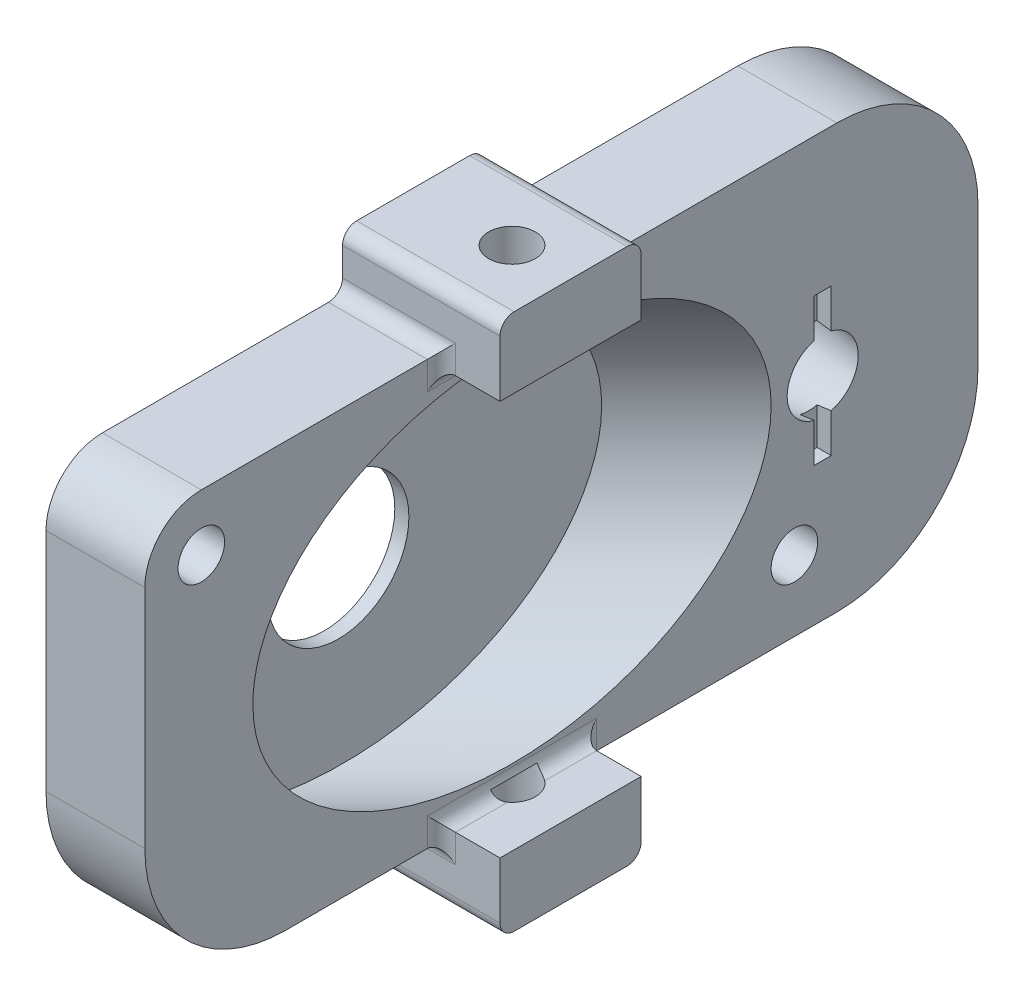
ISO-10303-21;
HEADER;
FILE_DESCRIPTION(('STEP AP214'),'2;1');
FILE_NAME('part.step','',(''),(''),'','','');
FILE_SCHEMA(('AUTOMOTIVE_DESIGN { 1 0 10303 214 1 1 1 1 }'));
ENDSEC;
DATA;
#1=APPLICATION_CONTEXT('core data for automotive mechanical design processes');
#2=APPLICATION_PROTOCOL_DEFINITION('international standard','automotive_design',2000,#1);
#3=PRODUCT_CONTEXT('',#1,'mechanical');
#4=PRODUCT('Part','Part','',(#3));
#5=PRODUCT_RELATED_PRODUCT_CATEGORY('part','',(#4));
#6=PRODUCT_DEFINITION_FORMATION('','',#4);
#7=PRODUCT_DEFINITION_CONTEXT('part definition',#1,'design');
#8=PRODUCT_DEFINITION('design','',#6,#7);
#9=PRODUCT_DEFINITION_SHAPE('','',#8);
#10=(LENGTH_UNIT() NAMED_UNIT(*) SI_UNIT(.MILLI.,.METRE.));
#11=(NAMED_UNIT(*) PLANE_ANGLE_UNIT() SI_UNIT($,.RADIAN.));
#12=(NAMED_UNIT(*) SI_UNIT($,.STERADIAN.) SOLID_ANGLE_UNIT());
#13=UNCERTAINTY_MEASURE_WITH_UNIT(LENGTH_MEASURE(1.E-05),#10,'distance_accuracy_value','');
#14=(GEOMETRIC_REPRESENTATION_CONTEXT(3) GLOBAL_UNCERTAINTY_ASSIGNED_CONTEXT((#13)) GLOBAL_UNIT_ASSIGNED_CONTEXT((#10,
#11,#12)) REPRESENTATION_CONTEXT('',''));
#15=CARTESIAN_POINT('',(0.,0.,0.));
#16=DIRECTION('',(0.,0.,1.));
#17=DIRECTION('',(1.,0.,0.));
#18=AXIS2_PLACEMENT_3D('',#15,#16,#17);
#19=CARTESIAN_POINT('',(1.,11.,22.));
#20=DIRECTION('',(-1.,0.,0.));
#21=DIRECTION('',(0.,0.,1.));
#22=AXIS2_PLACEMENT_3D('',#19,#20,#21);
#23=CYLINDRICAL_SURFACE('',#22,1.65);
#24=CARTESIAN_POINT('',(7.,11.,22.));
#25=DIRECTION('',(1.,0.,0.));
#26=DIRECTION('',(0.,0.,-1.));
#27=AXIS2_PLACEMENT_3D('',#24,#25,#26);
#28=CIRCLE('',#27,1.65);
#29=CARTESIAN_POINT('',(7.,11.,20.35));
#30=VERTEX_POINT('',#29);
#31=EDGE_CURVE('E1159',#30,#30,#28,.T.);
#32=ORIENTED_EDGE('',*,*,#31,.T.);
#33=EDGE_LOOP('',(#32));
#34=FACE_BOUND('',#33,.T.);
#35=CARTESIAN_POINT('',(2.1,11.,22.));
#36=DIRECTION('',(-1.,0.,0.));
#37=DIRECTION('',(0.,0.,1.));
#38=AXIS2_PLACEMENT_3D('',#35,#36,#37);
#39=CIRCLE('',#38,1.65);
#40=CARTESIAN_POINT('',(2.1,11.,23.65));
#41=VERTEX_POINT('',#40);
#42=EDGE_CURVE('E523',#41,#41,#39,.T.);
#43=ORIENTED_EDGE('',*,*,#42,.T.);
#44=EDGE_LOOP('',(#43));
#45=FACE_BOUND('',#44,.T.);
#46=ADVANCED_FACE('F45',(#34,#45),#23,.F.);
#47=CARTESIAN_POINT('',(1.,-10.,-20.));
#48=DIRECTION('',(-1.,0.,0.));
#49=DIRECTION('',(0.,0.,1.));
#50=AXIS2_PLACEMENT_3D('',#47,#48,#49);
#51=CYLINDRICAL_SURFACE('',#50,1.65);
#52=CARTESIAN_POINT('',(7.,-10.,-20.));
#53=DIRECTION('',(1.,0.,0.));
#54=DIRECTION('',(0.,0.,-1.));
#55=AXIS2_PLACEMENT_3D('',#52,#53,#54);
#56=CIRCLE('',#55,1.65);
#57=CARTESIAN_POINT('',(7.,-10.,-21.65));
#58=VERTEX_POINT('',#57);
#59=EDGE_CURVE('E1143',#58,#58,#56,.T.);
#60=ORIENTED_EDGE('',*,*,#59,.T.);
#61=EDGE_LOOP('',(#60));
#62=FACE_BOUND('',#61,.T.);
#63=CARTESIAN_POINT('',(2.1,-10.,-20.));
#64=DIRECTION('',(-1.,0.,0.));
#65=DIRECTION('',(0.,0.,1.));
#66=AXIS2_PLACEMENT_3D('',#63,#64,#65);
#67=CIRCLE('',#66,1.65);
#68=CARTESIAN_POINT('',(2.1,-10.,-18.35));
#69=VERTEX_POINT('',#68);
#70=EDGE_CURVE('E448',#69,#69,#67,.T.);
#71=ORIENTED_EDGE('',*,*,#70,.T.);
#72=EDGE_LOOP('',(#71));
#73=FACE_BOUND('',#72,.T.);
#74=ADVANCED_FACE('F611',(#62,#73),#51,.F.);
#75=CARTESIAN_POINT('',(7.,0.,0.));
#76=DIRECTION('',(1.,0.,0.));
#77=DIRECTION('',(0.,0.,-1.));
#78=AXIS2_PLACEMENT_3D('',#75,#76,#77);
#79=PLANE('',#78);
#80=DIRECTION('',(0.,-1.,0.));
#81=VECTOR('',#80,1.);
#82=CARTESIAN_POINT('',(7.,-5.2,-21.4));
#83=LINE('',#82,#81);
#84=CARTESIAN_POINT('',(7.,-2.44143828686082,-21.4));
#85=VERTEX_POINT('',#84);
#86=CARTESIAN_POINT('',(7.,-5.2,-21.4));
#87=VERTEX_POINT('',#86);
#88=EDGE_CURVE('E530',#85,#87,#83,.T.);
#89=ORIENTED_EDGE('',*,*,#88,.F.);
#90=CARTESIAN_POINT('',(7.,0.,-22.));
#91=DIRECTION('',(1.,0.,0.));
#92=DIRECTION('',(0.,0.,-1.));
#93=AXIS2_PLACEMENT_3D('',#90,#91,#92);
#94=CIRCLE('',#93,2.51408450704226);
#95=CARTESIAN_POINT('',(7.,2.44143828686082,-21.4));
#96=VERTEX_POINT('',#95);
#97=EDGE_CURVE('E814',#85,#96,#94,.F.);
#98=ORIENTED_EDGE('',*,*,#97,.T.);
#99=CARTESIAN_POINT('',(7.,5.2,-21.4));
#100=VERTEX_POINT('',#99);
#101=EDGE_CURVE('E508',#100,#96,#83,.T.);
#102=ORIENTED_EDGE('',*,*,#101,.F.);
#103=DIRECTION('',(0.,0.,1.));
#104=VECTOR('',#103,1.);
#105=CARTESIAN_POINT('',(7.,5.2,-21.4));
#106=LINE('',#105,#104);
#107=CARTESIAN_POINT('',(7.,5.2,-22.6));
#108=VERTEX_POINT('',#107);
#109=EDGE_CURVE('E527',#108,#100,#106,.T.);
#110=ORIENTED_EDGE('',*,*,#109,.F.);
#111=DIRECTION('',(0.,1.,0.));
#112=VECTOR('',#111,1.);
#113=CARTESIAN_POINT('',(7.,-5.2,-22.6));
#114=LINE('',#113,#112);
#115=CARTESIAN_POINT('',(7.,2.44143828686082,-22.6));
#116=VERTEX_POINT('',#115);
#117=EDGE_CURVE('E522',#116,#108,#114,.T.);
#118=ORIENTED_EDGE('',*,*,#117,.F.);
#119=CARTESIAN_POINT('',(7.,0.,-22.));
#120=DIRECTION('',(1.,0.,0.));
#121=DIRECTION('',(0.,0.,-1.));
#122=AXIS2_PLACEMENT_3D('',#119,#120,#121);
#123=CIRCLE('',#122,2.51408450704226);
#124=CARTESIAN_POINT('',(7.,0.,-24.5140845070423));
#125=VERTEX_POINT('',#124);
#126=EDGE_CURVE('E809',#116,#125,#123,.F.);
#127=ORIENTED_EDGE('',*,*,#126,.T.);
#128=CARTESIAN_POINT('',(7.,0.,-22.));
#129=DIRECTION('',(1.,0.,0.));
#130=DIRECTION('',(0.,0.,-1.));
#131=AXIS2_PLACEMENT_3D('',#128,#129,#130);
#132=CIRCLE('',#131,2.51408450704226);
#133=CARTESIAN_POINT('',(7.,-2.44143828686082,-22.6));
#134=VERTEX_POINT('',#133);
#135=EDGE_CURVE('E811',#125,#134,#132,.F.);
#136=ORIENTED_EDGE('',*,*,#135,.T.);
#137=CARTESIAN_POINT('',(7.,-5.2,-22.6));
#138=VERTEX_POINT('',#137);
#139=EDGE_CURVE('E524',#138,#134,#114,.T.);
#140=ORIENTED_EDGE('',*,*,#139,.F.);
#141=DIRECTION('',(0.,0.,-1.));
#142=VECTOR('',#141,1.);
#143=CARTESIAN_POINT('',(7.,-5.2,-21.4));
#144=LINE('',#143,#142);
#145=EDGE_CURVE('E519',#87,#138,#144,.T.);
#146=ORIENTED_EDGE('',*,*,#145,.F.);
#147=EDGE_LOOP('',(#89,#98,#102,#110,#118,#127,#136,#140,#146));
#148=FACE_BOUND('',#147,.T.);
#149=CARTESIAN_POINT('',(7.,0.,0.));
#150=DIRECTION('',(1.,0.,0.));
#151=DIRECTION('',(0.,0.,1.));
#152=AXIS2_PLACEMENT_3D('',#149,#150,#151);
#153=ELLIPSE('',#152,18.35,12.8);
#154=CARTESIAN_POINT('',(7.,0.,18.35));
#155=VERTEX_POINT('',#154);
#156=EDGE_CURVE('E569',#155,#155,#153,.T.);
#157=ORIENTED_EDGE('',*,*,#156,.F.);
#158=EDGE_LOOP('',(#157));
#159=FACE_BOUND('',#158,.T.);
#160=ORIENTED_EDGE('',*,*,#59,.F.);
#161=EDGE_LOOP('',(#160));
#162=FACE_BOUND('',#161,.T.);
#163=ORIENTED_EDGE('',*,*,#31,.F.);
#164=EDGE_LOOP('',(#163));
#165=FACE_BOUND('',#164,.T.);
#166=DIRECTION('',(0.,0.,1.));
#167=VECTOR('',#166,1.);
#168=CARTESIAN_POINT('',(7.,15.,26.));
#169=LINE('',#168,#167);
#170=CARTESIAN_POINT('',(7.,15.,6.00000000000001));
#171=VERTEX_POINT('',#170);
#172=CARTESIAN_POINT('',(7.,15.,22.));
#173=VERTEX_POINT('',#172);
#174=EDGE_CURVE('E1148',#171,#173,#169,.T.);
#175=ORIENTED_EDGE('',*,*,#174,.T.);
#176=CARTESIAN_POINT('',(7.,11.,22.));
#177=DIRECTION('',(1.,0.,0.));
#178=DIRECTION('',(0.,0.,-1.));
#179=AXIS2_PLACEMENT_3D('',#176,#177,#178);
#180=CIRCLE('',#179,4.);
#181=CARTESIAN_POINT('',(7.,11.,26.));
#182=VERTEX_POINT('',#181);
#183=EDGE_CURVE('E804',#173,#182,#180,.T.);
#184=ORIENTED_EDGE('',*,*,#183,.T.);
#185=DIRECTION('',(0.,-1.,0.));
#186=VECTOR('',#185,1.);
#187=CARTESIAN_POINT('',(7.,-15.,26.));
#188=LINE('',#187,#186);
#189=CARTESIAN_POINT('',(7.,-5.,26.));
#190=VERTEX_POINT('',#189);
#191=EDGE_CURVE('E1146',#182,#190,#188,.T.);
#192=ORIENTED_EDGE('',*,*,#191,.T.);
#193=CARTESIAN_POINT('',(7.,-5.,16.));
#194=DIRECTION('',(1.,0.,0.));
#195=DIRECTION('',(0.,0.,-1.));
#196=AXIS2_PLACEMENT_3D('',#193,#194,#195);
#197=CIRCLE('',#196,10.);
#198=CARTESIAN_POINT('',(7.,-15.,16.));
#199=VERTEX_POINT('',#198);
#200=EDGE_CURVE('E957',#190,#199,#197,.T.);
#201=ORIENTED_EDGE('',*,*,#200,.T.);
#202=DIRECTION('',(0.,0.,-1.));
#203=VECTOR('',#202,1.);
#204=CARTESIAN_POINT('',(7.,-15.,26.));
#205=LINE('',#204,#203);
#206=CARTESIAN_POINT('',(7.,-15.,6.00000000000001));
#207=VERTEX_POINT('',#206);
#208=EDGE_CURVE('E1140',#199,#207,#205,.T.);
#209=ORIENTED_EDGE('',*,*,#208,.T.);
#210=DIRECTION('',(0.,-1.,0.));
#211=VECTOR('',#210,1.);
#212=CARTESIAN_POINT('',(7.,0.,5.99999999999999));
#213=LINE('',#212,#211);
#214=CARTESIAN_POINT('',(7.,-13.,6.));
#215=VERTEX_POINT('',#214);
#216=EDGE_CURVE('E987',#207,#215,#213,.F.);
#217=ORIENTED_EDGE('',*,*,#216,.T.);
#218=DIRECTION('',(0.,0.,1.));
#219=VECTOR('',#218,1.);
#220=CARTESIAN_POINT('',(7.,-13.,0.));
#221=LINE('',#220,#219);
#222=CARTESIAN_POINT('',(7.,-13.,-5.9999970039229));
#223=VERTEX_POINT('',#222);
#224=EDGE_CURVE('E1067',#215,#223,#221,.F.);
#225=ORIENTED_EDGE('',*,*,#224,.T.);
#226=DIRECTION('',(0.,1.,0.));
#227=VECTOR('',#226,1.);
#228=CARTESIAN_POINT('',(7.,0.,-5.99999999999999));
#229=LINE('',#228,#227);
#230=CARTESIAN_POINT('',(7.,-15.,-6.));
#231=VERTEX_POINT('',#230);
#232=EDGE_CURVE('E985',#223,#231,#229,.F.);
#233=ORIENTED_EDGE('',*,*,#232,.T.);
#234=DIRECTION('',(0.,0.,-1.));
#235=VECTOR('',#234,1.);
#236=CARTESIAN_POINT('',(7.,-15.,-5.));
#237=LINE('',#236,#235);
#238=CARTESIAN_POINT('',(7.,-15.,-23.));
#239=VERTEX_POINT('',#238);
#240=EDGE_CURVE('E1157',#231,#239,#237,.T.);
#241=ORIENTED_EDGE('',*,*,#240,.T.);
#242=CARTESIAN_POINT('',(7.,-4.99999999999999,-23.));
#243=DIRECTION('',(1.,0.,0.));
#244=DIRECTION('',(0.,0.,-1.));
#245=AXIS2_PLACEMENT_3D('',#242,#243,#244);
#246=CIRCLE('',#245,10.);
#247=CARTESIAN_POINT('',(7.,-4.99999999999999,-33.));
#248=VERTEX_POINT('',#247);
#249=EDGE_CURVE('E959',#239,#248,#246,.T.);
#250=ORIENTED_EDGE('',*,*,#249,.T.);
#251=DIRECTION('',(0.,1.,0.));
#252=VECTOR('',#251,1.);
#253=CARTESIAN_POINT('',(7.,-15.,-33.));
#254=LINE('',#253,#252);
#255=CARTESIAN_POINT('',(7.,4.99999999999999,-33.));
#256=VERTEX_POINT('',#255);
#257=EDGE_CURVE('E1154',#248,#256,#254,.T.);
#258=ORIENTED_EDGE('',*,*,#257,.T.);
#259=CARTESIAN_POINT('',(7.,4.99999999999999,-23.));
#260=DIRECTION('',(1.,0.,0.));
#261=DIRECTION('',(0.,0.,-1.));
#262=AXIS2_PLACEMENT_3D('',#259,#260,#261);
#263=CIRCLE('',#262,10.);
#264=CARTESIAN_POINT('',(7.,15.,-23.));
#265=VERTEX_POINT('',#264);
#266=EDGE_CURVE('E961',#256,#265,#263,.T.);
#267=ORIENTED_EDGE('',*,*,#266,.T.);
#268=DIRECTION('',(0.,0.,1.));
#269=VECTOR('',#268,1.);
#270=CARTESIAN_POINT('',(7.,15.,-5.));
#271=LINE('',#270,#269);
#272=CARTESIAN_POINT('',(7.,15.,-6.));
#273=VERTEX_POINT('',#272);
#274=EDGE_CURVE('E1151',#265,#273,#271,.T.);
#275=ORIENTED_EDGE('',*,*,#274,.T.);
#276=DIRECTION('',(0.,1.,0.));
#277=VECTOR('',#276,1.);
#278=CARTESIAN_POINT('',(7.,0.,-5.99999999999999));
#279=LINE('',#278,#277);
#280=CARTESIAN_POINT('',(7.,13.,-6.));
#281=VERTEX_POINT('',#280);
#282=EDGE_CURVE('E983',#273,#281,#279,.F.);
#283=ORIENTED_EDGE('',*,*,#282,.T.);
#284=DIRECTION('',(0.,0.,-1.));
#285=VECTOR('',#284,1.);
#286=CARTESIAN_POINT('',(7.,13.,0.));
#287=LINE('',#286,#285);
#288=CARTESIAN_POINT('',(7.,13.,5.9999970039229));
#289=VERTEX_POINT('',#288);
#290=EDGE_CURVE('E1070',#281,#289,#287,.F.);
#291=ORIENTED_EDGE('',*,*,#290,.T.);
#292=DIRECTION('',(0.,-1.,0.));
#293=VECTOR('',#292,1.);
#294=CARTESIAN_POINT('',(7.,0.,5.99999999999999));
#295=LINE('',#294,#293);
#296=EDGE_CURVE('E981',#289,#171,#295,.F.);
#297=ORIENTED_EDGE('',*,*,#296,.T.);
#298=EDGE_LOOP('',(#175,#184,#192,#201,#209,#217,#225,#233,#241,#250,#258,#267,#275,#283,#291,#297));
#299=FACE_BOUND('',#298,.T.);
#300=ADVANCED_FACE('F607',(#148,#159,#162,#165,#299),#79,.T.);
#301=CARTESIAN_POINT('',(0.,0.,0.));
#302=DIRECTION('',(1.,0.,0.));
#303=DIRECTION('',(0.,0.,-1.));
#304=AXIS2_PLACEMENT_3D('',#301,#302,#303);
#305=PLANE('',#304);
#306=CARTESIAN_POINT('',(0.,0.,-22.));
#307=DIRECTION('',(1.,0.,0.));
#308=DIRECTION('',(0.,0.,-1.));
#309=AXIS2_PLACEMENT_3D('',#306,#307,#308);
#310=CIRCLE('',#309,3.50000000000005);
#311=CARTESIAN_POINT('',(0.,0.,-25.5));
#312=VERTEX_POINT('',#311);
#313=EDGE_CURVE('E806',#312,#312,#310,.T.);
#314=ORIENTED_EDGE('',*,*,#313,.T.);
#315=EDGE_LOOP('',(#314));
#316=FACE_BOUND('',#315,.T.);
#317=DIRECTION('',(0.,0.,1.));
#318=VECTOR('',#317,1.);
#319=CARTESIAN_POINT('',(0.,-12.85,-21.6454482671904));
#320=LINE('',#319,#318);
#321=CARTESIAN_POINT('',(0.,-12.85,-21.6454482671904));
#322=VERTEX_POINT('',#321);
#323=CARTESIAN_POINT('',(0.,-12.85,-18.3545517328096));
#324=VERTEX_POINT('',#323);
#325=EDGE_CURVE('E435',#322,#324,#320,.T.);
#326=ORIENTED_EDGE('',*,*,#325,.F.);
#327=DIRECTION('',(0.,-0.866025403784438,0.500000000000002));
#328=VECTOR('',#327,1.);
#329=CARTESIAN_POINT('',(0.,-10.,-23.2908965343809));
#330=LINE('',#329,#328);
#331=CARTESIAN_POINT('',(0.,-10.,-23.2908965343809));
#332=VERTEX_POINT('',#331);
#333=EDGE_CURVE('E403',#332,#322,#330,.T.);
#334=ORIENTED_EDGE('',*,*,#333,.F.);
#335=DIRECTION('',(0.,-0.86602540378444,-0.499999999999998));
#336=VECTOR('',#335,1.);
#337=CARTESIAN_POINT('',(0.,-7.15,-21.6454482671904));
#338=LINE('',#337,#336);
#339=CARTESIAN_POINT('',(0.,-7.15,-21.6454482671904));
#340=VERTEX_POINT('',#339);
#341=EDGE_CURVE('E421',#340,#332,#338,.T.);
#342=ORIENTED_EDGE('',*,*,#341,.F.);
#343=DIRECTION('',(0.,0.,-1.));
#344=VECTOR('',#343,1.);
#345=CARTESIAN_POINT('',(0.,-7.15,-18.3545517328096));
#346=LINE('',#345,#344);
#347=CARTESIAN_POINT('',(0.,-7.15,-18.3545517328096));
#348=VERTEX_POINT('',#347);
#349=EDGE_CURVE('E424',#348,#340,#346,.T.);
#350=ORIENTED_EDGE('',*,*,#349,.F.);
#351=DIRECTION('',(0.,0.866025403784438,-0.500000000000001));
#352=VECTOR('',#351,1.);
#353=CARTESIAN_POINT('',(0.,-9.99999999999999,-16.7091034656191));
#354=LINE('',#353,#352);
#355=CARTESIAN_POINT('',(0.,-9.99999999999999,-16.7091034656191));
#356=VERTEX_POINT('',#355);
#357=EDGE_CURVE('E441',#356,#348,#354,.T.);
#358=ORIENTED_EDGE('',*,*,#357,.F.);
#359=DIRECTION('',(0.,0.86602540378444,0.499999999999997));
#360=VECTOR('',#359,1.);
#361=CARTESIAN_POINT('',(0.,-12.85,-18.3545517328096));
#362=LINE('',#361,#360);
#363=EDGE_CURVE('E438',#324,#356,#362,.T.);
#364=ORIENTED_EDGE('',*,*,#363,.F.);
#365=EDGE_LOOP('',(#326,#334,#342,#350,#358,#364));
#366=FACE_BOUND('',#365,.T.);
#367=DIRECTION('',(0.,-0.642787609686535,0.766044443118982));
#368=VECTOR('',#367,1.);
#369=CARTESIAN_POINT('',(0.,9.87444709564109,18.9075688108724));
#370=LINE('',#369,#368);
#371=CARTESIAN_POINT('',(0.,9.87444709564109,18.9075688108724));
#372=VERTEX_POINT('',#371);
#373=CARTESIAN_POINT('',(0.,7.75909957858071,21.4285418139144));
#374=VERTEX_POINT('',#373);
#375=EDGE_CURVE('E484',#372,#374,#370,.T.);
#376=ORIENTED_EDGE('',*,*,#375,.F.);
#377=DIRECTION('',(0.,-0.984807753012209,-0.173648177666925));
#378=VECTOR('',#377,1.);
#379=CARTESIAN_POINT('',(0.,13.1153475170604,19.479026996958));
#380=LINE('',#379,#378);
#381=CARTESIAN_POINT('',(0.,13.1153475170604,19.479026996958));
#382=VERTEX_POINT('',#381);
#383=EDGE_CURVE('E436',#382,#372,#380,.T.);
#384=ORIENTED_EDGE('',*,*,#383,.F.);
#385=DIRECTION('',(0.,-0.342020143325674,-0.939692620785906));
#386=VECTOR('',#385,1.);
#387=CARTESIAN_POINT('',(0.,14.2409004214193,22.5714581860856));
#388=LINE('',#387,#386);
#389=CARTESIAN_POINT('',(0.,14.2409004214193,22.5714581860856));
#390=VERTEX_POINT('',#389);
#391=EDGE_CURVE('E471',#390,#382,#388,.T.);
#392=ORIENTED_EDGE('',*,*,#391,.F.);
#393=DIRECTION('',(0.,0.642787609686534,-0.766044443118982));
#394=VECTOR('',#393,1.);
#395=CARTESIAN_POINT('',(0.,12.1255529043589,25.0924311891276));
#396=LINE('',#395,#394);
#397=CARTESIAN_POINT('',(0.,12.1255529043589,25.0924311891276));
#398=VERTEX_POINT('',#397);
#399=EDGE_CURVE('E474',#398,#390,#396,.T.);
#400=ORIENTED_EDGE('',*,*,#399,.F.);
#401=DIRECTION('',(0.,0.984807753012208,0.173648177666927));
#402=VECTOR('',#401,1.);
#403=CARTESIAN_POINT('',(0.,8.88465248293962,24.520973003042));
#404=LINE('',#403,#402);
#405=CARTESIAN_POINT('',(0.,8.88465248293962,24.520973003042));
#406=VERTEX_POINT('',#405);
#407=EDGE_CURVE('E478',#406,#398,#404,.T.);
#408=ORIENTED_EDGE('',*,*,#407,.F.);
#409=DIRECTION('',(0.,0.342020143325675,0.939692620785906));
#410=VECTOR('',#409,1.);
#411=CARTESIAN_POINT('',(0.,7.75909957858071,21.4285418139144));
#412=LINE('',#411,#410);
#413=EDGE_CURVE('E481',#374,#406,#412,.T.);
#414=ORIENTED_EDGE('',*,*,#413,.F.);
#415=EDGE_LOOP('',(#376,#384,#392,#400,#408,#414));
#416=FACE_BOUND('',#415,.T.);
#417=DIRECTION('',(0.,-1.,0.));
#418=VECTOR('',#417,1.);
#419=CARTESIAN_POINT('',(0.,-15.,26.));
#420=LINE('',#419,#418);
#421=CARTESIAN_POINT('',(0.,11.,26.));
#422=VERTEX_POINT('',#421);
#423=CARTESIAN_POINT('',(0.,-5.,26.));
#424=VERTEX_POINT('',#423);
#425=EDGE_CURVE('E1135',#422,#424,#420,.T.);
#426=ORIENTED_EDGE('',*,*,#425,.F.);
#427=CARTESIAN_POINT('',(0.,11.,22.));
#428=DIRECTION('',(1.,0.,0.));
#429=DIRECTION('',(0.,0.,-1.));
#430=AXIS2_PLACEMENT_3D('',#427,#428,#429);
#431=CIRCLE('',#430,4.);
#432=CARTESIAN_POINT('',(0.,15.,22.));
#433=VERTEX_POINT('',#432);
#434=EDGE_CURVE('E800',#422,#433,#431,.F.);
#435=ORIENTED_EDGE('',*,*,#434,.T.);
#436=DIRECTION('',(0.,0.,1.));
#437=VECTOR('',#436,1.);
#438=CARTESIAN_POINT('',(0.,15.,5.));
#439=LINE('',#438,#437);
#440=CARTESIAN_POINT('',(0.,15.,6.));
#441=VERTEX_POINT('',#440);
#442=EDGE_CURVE('E1099',#441,#433,#439,.T.);
#443=ORIENTED_EDGE('',*,*,#442,.F.);
#444=CARTESIAN_POINT('',(0.,16.,6.));
#445=DIRECTION('',(1.,0.,0.));
#446=DIRECTION('',(0.,0.,-1.));
#447=AXIS2_PLACEMENT_3D('',#444,#445,#446);
#448=CIRCLE('',#447,1.);
#449=CARTESIAN_POINT('',(0.,16.,5.));
#450=VERTEX_POINT('',#449);
#451=EDGE_CURVE('E1048',#441,#450,#448,.T.);
#452=ORIENTED_EDGE('',*,*,#451,.T.);
#453=DIRECTION('',(0.,-1.,0.));
#454=VECTOR('',#453,1.);
#455=CARTESIAN_POINT('',(0.,15.,5.));
#456=LINE('',#455,#454);
#457=CARTESIAN_POINT('',(0.,18.,5.));
#458=VERTEX_POINT('',#457);
#459=EDGE_CURVE('E1104',#458,#450,#456,.T.);
#460=ORIENTED_EDGE('',*,*,#459,.F.);
#461=CARTESIAN_POINT('',(0.,18.,4.));
#462=DIRECTION('',(1.,0.,0.));
#463=DIRECTION('',(0.,0.,-1.));
#464=AXIS2_PLACEMENT_3D('',#461,#462,#463);
#465=CIRCLE('',#464,1.);
#466=CARTESIAN_POINT('',(0.,19.,4.));
#467=VERTEX_POINT('',#466);
#468=EDGE_CURVE('E1020',#458,#467,#465,.F.);
#469=ORIENTED_EDGE('',*,*,#468,.T.);
#470=DIRECTION('',(0.,0.,1.));
#471=VECTOR('',#470,1.);
#472=CARTESIAN_POINT('',(0.,19.,5.));
#473=LINE('',#472,#471);
#474=CARTESIAN_POINT('',(0.,19.,-4.));
#475=VERTEX_POINT('',#474);
#476=EDGE_CURVE('E1109',#475,#467,#473,.T.);
#477=ORIENTED_EDGE('',*,*,#476,.F.);
#478=CARTESIAN_POINT('',(0.,18.,-4.));
#479=DIRECTION('',(1.,0.,0.));
#480=DIRECTION('',(0.,0.,-1.));
#481=AXIS2_PLACEMENT_3D('',#478,#479,#480);
#482=CIRCLE('',#481,1.);
#483=CARTESIAN_POINT('',(0.,18.,-5.));
#484=VERTEX_POINT('',#483);
#485=EDGE_CURVE('E1018',#475,#484,#482,.F.);
#486=ORIENTED_EDGE('',*,*,#485,.T.);
#487=DIRECTION('',(0.,1.,0.));
#488=VECTOR('',#487,1.);
#489=CARTESIAN_POINT('',(0.,19.,-5.));
#490=LINE('',#489,#488);
#491=CARTESIAN_POINT('',(0.,16.,-5.));
#492=VERTEX_POINT('',#491);
#493=EDGE_CURVE('E1112',#492,#484,#490,.T.);
#494=ORIENTED_EDGE('',*,*,#493,.F.);
#495=CARTESIAN_POINT('',(0.,16.,-6.));
#496=DIRECTION('',(1.,0.,0.));
#497=DIRECTION('',(0.,0.,-1.));
#498=AXIS2_PLACEMENT_3D('',#495,#496,#497);
#499=CIRCLE('',#498,1.);
#500=CARTESIAN_POINT('',(0.,15.,-6.));
#501=VERTEX_POINT('',#500);
#502=EDGE_CURVE('E1046',#492,#501,#499,.T.);
#503=ORIENTED_EDGE('',*,*,#502,.T.);
#504=DIRECTION('',(0.,0.,1.));
#505=VECTOR('',#504,1.);
#506=CARTESIAN_POINT('',(0.,15.,-33.));
#507=LINE('',#506,#505);
#508=CARTESIAN_POINT('',(0.,15.,-23.));
#509=VERTEX_POINT('',#508);
#510=EDGE_CURVE('E1115',#509,#501,#507,.T.);
#511=ORIENTED_EDGE('',*,*,#510,.F.);
#512=CARTESIAN_POINT('',(0.,4.99999999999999,-23.));
#513=DIRECTION('',(1.,0.,0.));
#514=DIRECTION('',(0.,0.,-1.));
#515=AXIS2_PLACEMENT_3D('',#512,#513,#514);
#516=CIRCLE('',#515,10.);
#517=CARTESIAN_POINT('',(0.,4.99999999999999,-33.));
#518=VERTEX_POINT('',#517);
#519=EDGE_CURVE('E950',#509,#518,#516,.F.);
#520=ORIENTED_EDGE('',*,*,#519,.T.);
#521=DIRECTION('',(0.,1.,0.));
#522=VECTOR('',#521,1.);
#523=CARTESIAN_POINT('',(0.,-15.,-33.));
#524=LINE('',#523,#522);
#525=CARTESIAN_POINT('',(0.,-4.99999999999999,-33.));
#526=VERTEX_POINT('',#525);
#527=EDGE_CURVE('E1118',#526,#518,#524,.T.);
#528=ORIENTED_EDGE('',*,*,#527,.F.);
#529=CARTESIAN_POINT('',(0.,-4.99999999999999,-23.));
#530=DIRECTION('',(1.,0.,0.));
#531=DIRECTION('',(0.,0.,-1.));
#532=AXIS2_PLACEMENT_3D('',#529,#530,#531);
#533=CIRCLE('',#532,10.);
#534=CARTESIAN_POINT('',(0.,-15.,-23.));
#535=VERTEX_POINT('',#534);
#536=EDGE_CURVE('E947',#526,#535,#533,.F.);
#537=ORIENTED_EDGE('',*,*,#536,.T.);
#538=DIRECTION('',(0.,0.,-1.));
#539=VECTOR('',#538,1.);
#540=CARTESIAN_POINT('',(0.,-15.,-5.));
#541=LINE('',#540,#539);
#542=CARTESIAN_POINT('',(0.,-15.,-6.));
#543=VERTEX_POINT('',#542);
#544=EDGE_CURVE('E1121',#543,#535,#541,.T.);
#545=ORIENTED_EDGE('',*,*,#544,.F.);
#546=CARTESIAN_POINT('',(0.,-16.,-6.));
#547=DIRECTION('',(1.,0.,0.));
#548=DIRECTION('',(0.,0.,-1.));
#549=AXIS2_PLACEMENT_3D('',#546,#547,#548);
#550=CIRCLE('',#549,1.);
#551=CARTESIAN_POINT('',(0.,-16.,-5.));
#552=VERTEX_POINT('',#551);
#553=EDGE_CURVE('E1050',#543,#552,#550,.T.);
#554=ORIENTED_EDGE('',*,*,#553,.T.);
#555=DIRECTION('',(0.,1.,0.));
#556=VECTOR('',#555,1.);
#557=CARTESIAN_POINT('',(0.,-19.,-5.));
#558=LINE('',#557,#556);
#559=CARTESIAN_POINT('',(0.,-18.,-5.));
#560=VERTEX_POINT('',#559);
#561=EDGE_CURVE('E1123',#560,#552,#558,.T.);
#562=ORIENTED_EDGE('',*,*,#561,.F.);
#563=CARTESIAN_POINT('',(0.,-18.,-4.));
#564=DIRECTION('',(1.,0.,0.));
#565=DIRECTION('',(0.,0.,-1.));
#566=AXIS2_PLACEMENT_3D('',#563,#564,#565);
#567=CIRCLE('',#566,1.);
#568=CARTESIAN_POINT('',(0.,-19.,-4.));
#569=VERTEX_POINT('',#568);
#570=EDGE_CURVE('E1016',#560,#569,#567,.F.);
#571=ORIENTED_EDGE('',*,*,#570,.T.);
#572=DIRECTION('',(0.,0.,-1.));
#573=VECTOR('',#572,1.);
#574=CARTESIAN_POINT('',(0.,-19.,5.));
#575=LINE('',#574,#573);
#576=CARTESIAN_POINT('',(0.,-19.,4.));
#577=VERTEX_POINT('',#576);
#578=EDGE_CURVE('E1126',#577,#569,#575,.T.);
#579=ORIENTED_EDGE('',*,*,#578,.F.);
#580=CARTESIAN_POINT('',(0.,-18.,4.));
#581=DIRECTION('',(1.,0.,0.));
#582=DIRECTION('',(0.,0.,-1.));
#583=AXIS2_PLACEMENT_3D('',#580,#581,#582);
#584=CIRCLE('',#583,1.);
#585=CARTESIAN_POINT('',(0.,-18.,5.));
#586=VERTEX_POINT('',#585);
#587=EDGE_CURVE('E1014',#577,#586,#584,.F.);
#588=ORIENTED_EDGE('',*,*,#587,.T.);
#589=DIRECTION('',(0.,-1.,0.));
#590=VECTOR('',#589,1.);
#591=CARTESIAN_POINT('',(0.,-15.,5.));
#592=LINE('',#591,#590);
#593=CARTESIAN_POINT('',(0.,-16.,5.));
#594=VERTEX_POINT('',#593);
#595=EDGE_CURVE('E1129',#594,#586,#592,.T.);
#596=ORIENTED_EDGE('',*,*,#595,.F.);
#597=CARTESIAN_POINT('',(0.,-16.,6.));
#598=DIRECTION('',(1.,0.,0.));
#599=DIRECTION('',(0.,0.,-1.));
#600=AXIS2_PLACEMENT_3D('',#597,#598,#599);
#601=CIRCLE('',#600,1.);
#602=CARTESIAN_POINT('',(0.,-15.,6.00000000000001));
#603=VERTEX_POINT('',#602);
#604=EDGE_CURVE('E1044',#594,#603,#601,.T.);
#605=ORIENTED_EDGE('',*,*,#604,.T.);
#606=DIRECTION('',(0.,0.,-1.));
#607=VECTOR('',#606,1.);
#608=CARTESIAN_POINT('',(0.,-15.,26.));
#609=LINE('',#608,#607);
#610=CARTESIAN_POINT('',(0.,-15.,16.));
#611=VERTEX_POINT('',#610);
#612=EDGE_CURVE('E1132',#611,#603,#609,.T.);
#613=ORIENTED_EDGE('',*,*,#612,.F.);
#614=CARTESIAN_POINT('',(0.,-5.,16.));
#615=DIRECTION('',(1.,0.,0.));
#616=DIRECTION('',(0.,0.,-1.));
#617=AXIS2_PLACEMENT_3D('',#614,#615,#616);
#618=CIRCLE('',#617,10.);
#619=EDGE_CURVE('E944',#611,#424,#618,.F.);
#620=ORIENTED_EDGE('',*,*,#619,.T.);
#621=EDGE_LOOP('',(#426,#435,#443,#452,#460,#469,#477,#486,#494,#503,#511,#520,#528,#537,#545,
#554,#562,#571,#579,#588,#596,#605,#613,#620));
#622=FACE_BOUND('',#621,.T.);
#623=CARTESIAN_POINT('',(0.,0.,6.3));
#624=DIRECTION('',(1.,0.,0.));
#625=DIRECTION('',(0.,0.,-1.));
#626=AXIS2_PLACEMENT_3D('',#623,#624,#625);
#627=CIRCLE('',#626,5.);
#628=CARTESIAN_POINT('',(0.,0.,1.3));
#629=VERTEX_POINT('',#628);
#630=EDGE_CURVE('E1137',#629,#629,#627,.T.);
#631=ORIENTED_EDGE('',*,*,#630,.T.);
#632=EDGE_LOOP('',(#631));
#633=FACE_BOUND('',#632,.T.);
#634=ADVANCED_FACE('F610',(#316,#366,#416,#622,#633),#305,.F.);
#635=CARTESIAN_POINT('',(1.,-15.,26.));
#636=DIRECTION('',(0.,0.,-1.));
#637=DIRECTION('',(-1.,0.,0.));
#638=AXIS2_PLACEMENT_3D('',#635,#636,#637);
#639=PLANE('',#638);
#640=ORIENTED_EDGE('',*,*,#191,.F.);
#641=DIRECTION('',(-1.,0.,0.));
#642=VECTOR('',#641,1.);
#643=CARTESIAN_POINT('',(1.,11.,26.));
#644=LINE('',#643,#642);
#645=EDGE_CURVE('E796',#182,#422,#644,.T.);
#646=ORIENTED_EDGE('',*,*,#645,.T.);
#647=ORIENTED_EDGE('',*,*,#425,.T.);
#648=DIRECTION('',(-1.,0.,0.));
#649=VECTOR('',#648,1.);
#650=CARTESIAN_POINT('',(1.,-5.,26.));
#651=LINE('',#650,#649);
#652=EDGE_CURVE('E969',#424,#190,#651,.F.);
#653=ORIENTED_EDGE('',*,*,#652,.T.);
#654=EDGE_LOOP('',(#640,#646,#647,#653));
#655=FACE_BOUND('',#654,.T.);
#656=ADVANCED_FACE('F625',(#655),#639,.F.);
#657=CARTESIAN_POINT('',(1.,-15.,26.));
#658=DIRECTION('',(0.,1.,0.));
#659=DIRECTION('',(0.,0.,1.));
#660=AXIS2_PLACEMENT_3D('',#657,#658,#659);
#661=PLANE('',#660);
#662=ORIENTED_EDGE('',*,*,#612,.T.);
#663=DIRECTION('',(-1.,0.,0.));
#664=VECTOR('',#663,1.);
#665=CARTESIAN_POINT('',(7.,-15.,6.));
#666=LINE('',#665,#664);
#667=EDGE_CURVE('E979',#603,#207,#666,.F.);
#668=ORIENTED_EDGE('',*,*,#667,.T.);
#669=ORIENTED_EDGE('',*,*,#208,.F.);
#670=DIRECTION('',(-1.,0.,0.));
#671=VECTOR('',#670,1.);
#672=CARTESIAN_POINT('',(1.,-15.,16.));
#673=LINE('',#672,#671);
#674=EDGE_CURVE('E966',#199,#611,#673,.T.);
#675=ORIENTED_EDGE('',*,*,#674,.T.);
#676=EDGE_LOOP('',(#662,#668,#669,#675));
#677=FACE_BOUND('',#676,.T.);
#678=ADVANCED_FACE('F665',(#677),#661,.F.);
#679=CARTESIAN_POINT('',(1.,-15.,5.));
#680=DIRECTION('',(0.,0.,-1.));
#681=DIRECTION('',(0.,1.,0.));
#682=AXIS2_PLACEMENT_3D('',#679,#680,#681);
#683=PLANE('',#682);
#684=DIRECTION('',(0.,-1.,0.));
#685=VECTOR('',#684,1.);
#686=CARTESIAN_POINT('',(8.,-15.,5.));
#687=LINE('',#686,#685);
#688=CARTESIAN_POINT('',(8.,-14.,5.));
#689=VERTEX_POINT('',#688);
#690=CARTESIAN_POINT('',(8.,-16.,5.));
#691=VERTEX_POINT('',#690);
#692=EDGE_CURVE('E974',#689,#691,#687,.T.);
#693=ORIENTED_EDGE('',*,*,#692,.T.);
#694=DIRECTION('',(-1.,0.,0.));
#695=VECTOR('',#694,1.);
#696=CARTESIAN_POINT('',(0.,-16.,5.));
#697=LINE('',#696,#695);
#698=EDGE_CURVE('E976',#691,#594,#697,.T.);
#699=ORIENTED_EDGE('',*,*,#698,.T.);
#700=ORIENTED_EDGE('',*,*,#595,.T.);
#701=DIRECTION('',(-1.,0.,0.));
#702=VECTOR('',#701,1.);
#703=CARTESIAN_POINT('',(1.,-18.,5.));
#704=LINE('',#703,#702);
#705=CARTESIAN_POINT('',(11.15,-18.,5.));
#706=VERTEX_POINT('',#705);
#707=EDGE_CURVE('E972',#586,#706,#704,.F.);
#708=ORIENTED_EDGE('',*,*,#707,.T.);
#709=DIRECTION('',(0.,-1.,0.));
#710=VECTOR('',#709,1.);
#711=CARTESIAN_POINT('',(11.15,-19.,5.));
#712=LINE('',#711,#710);
#713=CARTESIAN_POINT('',(11.15,-14.,5.));
#714=VERTEX_POINT('',#713);
#715=EDGE_CURVE('E580',#714,#706,#712,.T.);
#716=ORIENTED_EDGE('',*,*,#715,.F.);
#717=DIRECTION('',(-1.,0.,0.));
#718=VECTOR('',#717,1.);
#719=CARTESIAN_POINT('',(11.15,-14.,5.));
#720=LINE('',#719,#718);
#721=EDGE_CURVE('E549',#714,#689,#720,.T.);
#722=ORIENTED_EDGE('',*,*,#721,.T.);
#723=EDGE_LOOP('',(#693,#699,#700,#708,#716,#722));
#724=FACE_BOUND('',#723,.T.);
#725=ADVANCED_FACE('F661',(#724),#683,.F.);
#726=CARTESIAN_POINT('',(1.,-19.,5.));
#727=DIRECTION('',(0.,1.,0.));
#728=DIRECTION('',(0.,0.,1.));
#729=AXIS2_PLACEMENT_3D('',#726,#727,#728);
#730=PLANE('',#729);
#731=CARTESIAN_POINT('',(7.,-19.,0.));
#732=DIRECTION('',(0.,-1.,0.));
#733=DIRECTION('',(0.,0.,-1.));
#734=AXIS2_PLACEMENT_3D('',#731,#732,#733);
#735=CIRCLE('',#734,1.65);
#736=CARTESIAN_POINT('',(7.,-19.,-1.65));
#737=VERTEX_POINT('',#736);
#738=EDGE_CURVE('E544',#737,#737,#735,.T.);
#739=ORIENTED_EDGE('',*,*,#738,.F.);
#740=EDGE_LOOP('',(#739));
#741=FACE_BOUND('',#740,.T.);
#742=ORIENTED_EDGE('',*,*,#578,.T.);
#743=DIRECTION('',(-1.,0.,0.));
#744=VECTOR('',#743,1.);
#745=CARTESIAN_POINT('',(1.,-19.,-4.));
#746=LINE('',#745,#744);
#747=CARTESIAN_POINT('',(11.15,-19.,-4.));
#748=VERTEX_POINT('',#747);
#749=EDGE_CURVE('E1038',#569,#748,#746,.F.);
#750=ORIENTED_EDGE('',*,*,#749,.T.);
#751=DIRECTION('',(0.,0.,-1.));
#752=VECTOR('',#751,1.);
#753=CARTESIAN_POINT('',(11.15,-19.,-5.));
#754=LINE('',#753,#752);
#755=CARTESIAN_POINT('',(11.15,-19.,4.));
#756=VERTEX_POINT('',#755);
#757=EDGE_CURVE('E577',#756,#748,#754,.T.);
#758=ORIENTED_EDGE('',*,*,#757,.F.);
#759=DIRECTION('',(-1.,0.,0.));
#760=VECTOR('',#759,1.);
#761=CARTESIAN_POINT('',(1.,-19.,4.));
#762=LINE('',#761,#760);
#763=EDGE_CURVE('E1035',#756,#577,#762,.T.);
#764=ORIENTED_EDGE('',*,*,#763,.T.);
#765=EDGE_LOOP('',(#742,#750,#758,#764));
#766=FACE_BOUND('',#765,.T.);
#767=ADVANCED_FACE('F657',(#741,#766),#730,.F.);
#768=CARTESIAN_POINT('',(1.,-19.,-5.));
#769=DIRECTION('',(0.,0.,1.));
#770=DIRECTION('',(0.,-1.,0.));
#771=AXIS2_PLACEMENT_3D('',#768,#769,#770);
#772=PLANE('',#771);
#773=DIRECTION('',(-1.,0.,0.));
#774=VECTOR('',#773,1.);
#775=CARTESIAN_POINT('',(7.,-16.,-5.));
#776=LINE('',#775,#774);
#777=CARTESIAN_POINT('',(8.,-16.,-5.));
#778=VERTEX_POINT('',#777);
#779=EDGE_CURVE('E992',#552,#778,#776,.F.);
#780=ORIENTED_EDGE('',*,*,#779,.T.);
#781=DIRECTION('',(0.,1.,0.));
#782=VECTOR('',#781,1.);
#783=CARTESIAN_POINT('',(8.,-19.,-5.));
#784=LINE('',#783,#782);
#785=CARTESIAN_POINT('',(8.,-14.,-5.));
#786=VERTEX_POINT('',#785);
#787=EDGE_CURVE('E994',#778,#786,#784,.T.);
#788=ORIENTED_EDGE('',*,*,#787,.T.);
#789=DIRECTION('',(-1.,0.,0.));
#790=VECTOR('',#789,1.);
#791=CARTESIAN_POINT('',(11.15,-14.,-5.));
#792=LINE('',#791,#790);
#793=CARTESIAN_POINT('',(11.15,-14.,-5.));
#794=VERTEX_POINT('',#793);
#795=EDGE_CURVE('E572',#794,#786,#792,.T.);
#796=ORIENTED_EDGE('',*,*,#795,.F.);
#797=DIRECTION('',(0.,1.,0.));
#798=VECTOR('',#797,1.);
#799=CARTESIAN_POINT('',(11.15,-14.,-5.));
#800=LINE('',#799,#798);
#801=CARTESIAN_POINT('',(11.15,-18.,-5.));
#802=VERTEX_POINT('',#801);
#803=EDGE_CURVE('E575',#802,#794,#800,.T.);
#804=ORIENTED_EDGE('',*,*,#803,.F.);
#805=DIRECTION('',(-1.,0.,0.));
#806=VECTOR('',#805,1.);
#807=CARTESIAN_POINT('',(1.,-18.,-5.));
#808=LINE('',#807,#806);
#809=EDGE_CURVE('E989',#802,#560,#808,.T.);
#810=ORIENTED_EDGE('',*,*,#809,.T.);
#811=ORIENTED_EDGE('',*,*,#561,.T.);
#812=EDGE_LOOP('',(#780,#788,#796,#804,#810,#811));
#813=FACE_BOUND('',#812,.T.);
#814=ADVANCED_FACE('F653',(#813),#772,.F.);
#815=CARTESIAN_POINT('',(1.,-15.,-5.));
#816=DIRECTION('',(0.,1.,0.));
#817=DIRECTION('',(0.,0.,1.));
#818=AXIS2_PLACEMENT_3D('',#815,#816,#817);
#819=PLANE('',#818);
#820=ORIENTED_EDGE('',*,*,#240,.F.);
#821=DIRECTION('',(-1.,0.,0.));
#822=VECTOR('',#821,1.);
#823=CARTESIAN_POINT('',(0.,-15.,-6.));
#824=LINE('',#823,#822);
#825=EDGE_CURVE('E1033',#231,#543,#824,.T.);
#826=ORIENTED_EDGE('',*,*,#825,.T.);
#827=ORIENTED_EDGE('',*,*,#544,.T.);
#828=DIRECTION('',(-1.,0.,0.));
#829=VECTOR('',#828,1.);
#830=CARTESIAN_POINT('',(1.,-15.,-23.));
#831=LINE('',#830,#829);
#832=EDGE_CURVE('E963',#535,#239,#831,.F.);
#833=ORIENTED_EDGE('',*,*,#832,.T.);
#834=EDGE_LOOP('',(#820,#826,#827,#833));
#835=FACE_BOUND('',#834,.T.);
#836=ADVANCED_FACE('F649',(#835),#819,.F.);
#837=CARTESIAN_POINT('',(1.,-15.,-33.));
#838=DIRECTION('',(0.,0.,1.));
#839=DIRECTION('',(1.,0.,0.));
#840=AXIS2_PLACEMENT_3D('',#837,#838,#839);
#841=PLANE('',#840);
#842=ORIENTED_EDGE('',*,*,#527,.T.);
#843=DIRECTION('',(-1.,0.,0.));
#844=VECTOR('',#843,1.);
#845=CARTESIAN_POINT('',(1.,4.99999999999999,-33.));
#846=LINE('',#845,#844);
#847=EDGE_CURVE('E955',#518,#256,#846,.F.);
#848=ORIENTED_EDGE('',*,*,#847,.T.);
#849=ORIENTED_EDGE('',*,*,#257,.F.);
#850=DIRECTION('',(-1.,0.,0.));
#851=VECTOR('',#850,1.);
#852=CARTESIAN_POINT('',(1.,-4.99999999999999,-33.));
#853=LINE('',#852,#851);
#854=EDGE_CURVE('E952',#248,#526,#853,.T.);
#855=ORIENTED_EDGE('',*,*,#854,.T.);
#856=EDGE_LOOP('',(#842,#848,#849,#855));
#857=FACE_BOUND('',#856,.T.);
#858=ADVANCED_FACE('F645',(#857),#841,.F.);
#859=CARTESIAN_POINT('',(1.,15.,-33.));
#860=DIRECTION('',(0.,-1.,0.));
#861=DIRECTION('',(0.,0.,-1.));
#862=AXIS2_PLACEMENT_3D('',#859,#860,#861);
#863=PLANE('',#862);
#864=ORIENTED_EDGE('',*,*,#510,.T.);
#865=DIRECTION('',(-1.,0.,0.));
#866=VECTOR('',#865,1.);
#867=CARTESIAN_POINT('',(7.,15.,-6.));
#868=LINE('',#867,#866);
#869=EDGE_CURVE('E1012',#501,#273,#868,.F.);
#870=ORIENTED_EDGE('',*,*,#869,.T.);
#871=ORIENTED_EDGE('',*,*,#274,.F.);
#872=DIRECTION('',(-1.,0.,0.));
#873=VECTOR('',#872,1.);
#874=CARTESIAN_POINT('',(1.,15.,-23.));
#875=LINE('',#874,#873);
#876=EDGE_CURVE('E941',#265,#509,#875,.T.);
#877=ORIENTED_EDGE('',*,*,#876,.T.);
#878=EDGE_LOOP('',(#864,#870,#871,#877));
#879=FACE_BOUND('',#878,.T.);
#880=ADVANCED_FACE('F641',(#879),#863,.F.);
#881=CARTESIAN_POINT('',(1.,19.,-5.));
#882=DIRECTION('',(0.,0.,1.));
#883=DIRECTION('',(0.,-1.,0.));
#884=AXIS2_PLACEMENT_3D('',#881,#882,#883);
#885=PLANE('',#884);
#886=DIRECTION('',(-1.,0.,0.));
#887=VECTOR('',#886,1.);
#888=CARTESIAN_POINT('',(11.15,14.,-5.));
#889=LINE('',#888,#887);
#890=CARTESIAN_POINT('',(11.15,14.,-5.));
#891=VERTEX_POINT('',#890);
#892=CARTESIAN_POINT('',(8.,14.,-5.));
#893=VERTEX_POINT('',#892);
#894=EDGE_CURVE('E563',#891,#893,#889,.T.);
#895=ORIENTED_EDGE('',*,*,#894,.T.);
#896=DIRECTION('',(0.,1.,0.));
#897=VECTOR('',#896,1.);
#898=CARTESIAN_POINT('',(8.,19.,-5.));
#899=LINE('',#898,#897);
#900=CARTESIAN_POINT('',(8.,16.,-5.));
#901=VERTEX_POINT('',#900);
#902=EDGE_CURVE('E1001',#893,#901,#899,.T.);
#903=ORIENTED_EDGE('',*,*,#902,.T.);
#904=DIRECTION('',(-1.,0.,0.));
#905=VECTOR('',#904,1.);
#906=CARTESIAN_POINT('',(0.,16.,-5.));
#907=LINE('',#906,#905);
#908=EDGE_CURVE('E999',#901,#492,#907,.T.);
#909=ORIENTED_EDGE('',*,*,#908,.T.);
#910=ORIENTED_EDGE('',*,*,#493,.T.);
#911=DIRECTION('',(-1.,0.,0.));
#912=VECTOR('',#911,1.);
#913=CARTESIAN_POINT('',(1.,18.,-5.));
#914=LINE('',#913,#912);
#915=CARTESIAN_POINT('',(11.15,18.,-5.));
#916=VERTEX_POINT('',#915);
#917=EDGE_CURVE('E997',#484,#916,#914,.F.);
#918=ORIENTED_EDGE('',*,*,#917,.T.);
#919=DIRECTION('',(0.,1.,0.));
#920=VECTOR('',#919,1.);
#921=CARTESIAN_POINT('',(11.15,14.,-5.));
#922=LINE('',#921,#920);
#923=EDGE_CURVE('E552',#891,#916,#922,.T.);
#924=ORIENTED_EDGE('',*,*,#923,.F.);
#925=EDGE_LOOP('',(#895,#903,#909,#910,#918,#924));
#926=FACE_BOUND('',#925,.T.);
#927=ADVANCED_FACE('F637',(#926),#885,.F.);
#928=CARTESIAN_POINT('',(1.,19.,5.));
#929=DIRECTION('',(0.,-1.,0.));
#930=DIRECTION('',(0.,0.,-1.));
#931=AXIS2_PLACEMENT_3D('',#928,#929,#930);
#932=PLANE('',#931);
#933=CARTESIAN_POINT('',(7.,19.,0.));
#934=DIRECTION('',(0.,-1.,0.));
#935=DIRECTION('',(0.,0.,-1.));
#936=AXIS2_PLACEMENT_3D('',#933,#934,#935);
#937=CIRCLE('',#936,1.65);
#938=CARTESIAN_POINT('',(7.,19.,-1.65));
#939=VERTEX_POINT('',#938);
#940=EDGE_CURVE('E535',#939,#939,#937,.T.);
#941=ORIENTED_EDGE('',*,*,#940,.T.);
#942=EDGE_LOOP('',(#941));
#943=FACE_BOUND('',#942,.T.);
#944=ORIENTED_EDGE('',*,*,#476,.T.);
#945=DIRECTION('',(-1.,0.,0.));
#946=VECTOR('',#945,1.);
#947=CARTESIAN_POINT('',(1.,19.,4.));
#948=LINE('',#947,#946);
#949=CARTESIAN_POINT('',(11.15,19.,4.));
#950=VERTEX_POINT('',#949);
#951=EDGE_CURVE('E1025',#467,#950,#948,.F.);
#952=ORIENTED_EDGE('',*,*,#951,.T.);
#953=DIRECTION('',(0.,0.,1.));
#954=VECTOR('',#953,1.);
#955=CARTESIAN_POINT('',(11.15,19.,-5.));
#956=LINE('',#955,#954);
#957=CARTESIAN_POINT('',(11.15,19.,-4.));
#958=VERTEX_POINT('',#957);
#959=EDGE_CURVE('E555',#958,#950,#956,.T.);
#960=ORIENTED_EDGE('',*,*,#959,.F.);
#961=DIRECTION('',(-1.,0.,0.));
#962=VECTOR('',#961,1.);
#963=CARTESIAN_POINT('',(1.,19.,-4.));
#964=LINE('',#963,#962);
#965=EDGE_CURVE('E1022',#958,#475,#964,.T.);
#966=ORIENTED_EDGE('',*,*,#965,.T.);
#967=EDGE_LOOP('',(#944,#952,#960,#966));
#968=FACE_BOUND('',#967,.T.);
#969=ADVANCED_FACE('F633',(#943,#968),#932,.F.);
#970=CARTESIAN_POINT('',(1.,15.,5.));
#971=DIRECTION('',(0.,0.,-1.));
#972=DIRECTION('',(0.,1.,0.));
#973=AXIS2_PLACEMENT_3D('',#970,#971,#972);
#974=PLANE('',#973);
#975=DIRECTION('',(0.,-1.,0.));
#976=VECTOR('',#975,1.);
#977=CARTESIAN_POINT('',(11.15,19.,5.));
#978=LINE('',#977,#976);
#979=CARTESIAN_POINT('',(11.15,18.,5.));
#980=VERTEX_POINT('',#979);
#981=CARTESIAN_POINT('',(11.15,14.,5.));
#982=VERTEX_POINT('',#981);
#983=EDGE_CURVE('E559',#980,#982,#978,.T.);
#984=ORIENTED_EDGE('',*,*,#983,.F.);
#985=DIRECTION('',(-1.,0.,0.));
#986=VECTOR('',#985,1.);
#987=CARTESIAN_POINT('',(1.,18.,5.));
#988=LINE('',#987,#986);
#989=EDGE_CURVE('E1009',#980,#458,#988,.T.);
#990=ORIENTED_EDGE('',*,*,#989,.T.);
#991=ORIENTED_EDGE('',*,*,#459,.T.);
#992=DIRECTION('',(-1.,0.,0.));
#993=VECTOR('',#992,1.);
#994=CARTESIAN_POINT('',(7.,16.,5.));
#995=LINE('',#994,#993);
#996=CARTESIAN_POINT('',(8.,16.,5.));
#997=VERTEX_POINT('',#996);
#998=EDGE_CURVE('E1004',#450,#997,#995,.F.);
#999=ORIENTED_EDGE('',*,*,#998,.T.);
#1000=DIRECTION('',(0.,-1.,0.));
#1001=VECTOR('',#1000,1.);
#1002=CARTESIAN_POINT('',(8.,15.,5.));
#1003=LINE('',#1002,#1001);
#1004=CARTESIAN_POINT('',(8.,14.,5.));
#1005=VERTEX_POINT('',#1004);
#1006=EDGE_CURVE('E1006',#997,#1005,#1003,.T.);
#1007=ORIENTED_EDGE('',*,*,#1006,.T.);
#1008=DIRECTION('',(-1.,0.,0.));
#1009=VECTOR('',#1008,1.);
#1010=CARTESIAN_POINT('',(11.15,14.,5.));
#1011=LINE('',#1010,#1009);
#1012=EDGE_CURVE('E566',#982,#1005,#1011,.T.);
#1013=ORIENTED_EDGE('',*,*,#1012,.F.);
#1014=EDGE_LOOP('',(#984,#990,#991,#999,#1007,#1013));
#1015=FACE_BOUND('',#1014,.T.);
#1016=ADVANCED_FACE('F629',(#1015),#974,.F.);
#1017=CARTESIAN_POINT('',(1.,15.,5.));
#1018=DIRECTION('',(0.,-1.,0.));
#1019=DIRECTION('',(0.,0.,-1.));
#1020=AXIS2_PLACEMENT_3D('',#1017,#1018,#1019);
#1021=PLANE('',#1020);
#1022=ORIENTED_EDGE('',*,*,#442,.T.);
#1023=DIRECTION('',(-1.,0.,0.));
#1024=VECTOR('',#1023,1.);
#1025=CARTESIAN_POINT('',(1.,15.,22.));
#1026=LINE('',#1025,#1024);
#1027=EDGE_CURVE('E802',#433,#173,#1026,.F.);
#1028=ORIENTED_EDGE('',*,*,#1027,.T.);
#1029=ORIENTED_EDGE('',*,*,#174,.F.);
#1030=DIRECTION('',(-1.,0.,0.));
#1031=VECTOR('',#1030,1.);
#1032=CARTESIAN_POINT('',(0.,15.,6.));
#1033=LINE('',#1032,#1031);
#1034=EDGE_CURVE('E1031',#171,#441,#1033,.T.);
#1035=ORIENTED_EDGE('',*,*,#1034,.T.);
#1036=EDGE_LOOP('',(#1022,#1028,#1029,#1035));
#1037=FACE_BOUND('',#1036,.T.);
#1038=ADVANCED_FACE('F621',(#1037),#1021,.F.);
#1039=CARTESIAN_POINT('',(1.,0.,6.3));
#1040=DIRECTION('',(-1.,0.,0.));
#1041=DIRECTION('',(0.,0.,1.));
#1042=AXIS2_PLACEMENT_3D('',#1039,#1040,#1041);
#1043=CYLINDRICAL_SURFACE('',#1042,5.);
#1044=CARTESIAN_POINT('',(1.,0.,6.3));
#1045=DIRECTION('',(1.,0.,0.));
#1046=DIRECTION('',(0.,0.,-1.));
#1047=AXIS2_PLACEMENT_3D('',#1044,#1045,#1046);
#1048=CIRCLE('',#1047,5.);
#1049=CARTESIAN_POINT('',(1.,0.,1.3));
#1050=VERTEX_POINT('',#1049);
#1051=EDGE_CURVE('E595',#1050,#1050,#1048,.T.);
#1052=ORIENTED_EDGE('',*,*,#1051,.T.);
#1053=EDGE_LOOP('',(#1052));
#1054=FACE_BOUND('',#1053,.T.);
#1055=ORIENTED_EDGE('',*,*,#630,.F.);
#1056=EDGE_LOOP('',(#1055));
#1057=FACE_BOUND('',#1056,.T.);
#1058=ADVANCED_FACE('F605',(#1054,#1057),#1043,.F.);
#1059=CARTESIAN_POINT('',(1.,0.,0.));
#1060=DIRECTION('',(-1.,0.,0.));
#1061=DIRECTION('',(0.,0.,1.));
#1062=AXIS2_PLACEMENT_3D('',#1059,#1060,#1061);
#1063=PLANE('',#1062);
#1064=CARTESIAN_POINT('',(1.,0.,24.35));
#1065=CARTESIAN_POINT('',(1.,-0.282100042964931,24.34999526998));
#1066=CARTESIAN_POINT('',(1.,-0.564266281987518,24.3365999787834));
#1067=CARTESIAN_POINT('',(1.,-1.12621407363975,24.2832966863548));
#1068=CARTESIAN_POINT('',(1.,-1.40599402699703,24.2433721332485));
#1069=CARTESIAN_POINT('',(1.,-1.96126496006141,24.1377679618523));
#1070=CARTESIAN_POINT('',(1.,-2.2367453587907,24.0720328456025));
#1071=CARTESIAN_POINT('',(1.,-2.78064754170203,23.9161894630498));
#1072=CARTESIAN_POINT('',(1.,-3.04907033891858,23.8260847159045));
#1073=CARTESIAN_POINT('',(1.,-3.57524534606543,23.6239508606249));
#1074=CARTESIAN_POINT('',(1.,-3.83306113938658,23.5120865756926));
#1075=CARTESIAN_POINT('',(1.,-4.33878796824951,23.2678811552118));
#1076=CARTESIAN_POINT('',(1.,-4.58669832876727,23.13553862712));
#1077=CARTESIAN_POINT('',(1.,-5.07146599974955,22.8524224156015));
#1078=CARTESIAN_POINT('',(1.,-5.30833189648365,22.7016633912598));
#1079=CARTESIAN_POINT('',(1.,-5.77063694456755,22.3835078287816));
#1080=CARTESIAN_POINT('',(1.,-5.9960732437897,22.2161071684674));
#1081=CARTESIAN_POINT('',(1.,-6.52444758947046,21.7953370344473));
#1082=CARTESIAN_POINT('',(1.,-6.82162228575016,21.5346905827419));
#1083=CARTESIAN_POINT('',(1.,-7.39190358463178,20.9889303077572));
#1084=CARTESIAN_POINT('',(1.,-7.66502380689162,20.7038305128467));
#1085=CARTESIAN_POINT('',(1.,-8.56269684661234,19.6888843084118));
#1086=CARTESIAN_POINT('',(1.,-9.12996050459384,18.9072021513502));
#1087=CARTESIAN_POINT('',(1.,-9.88083317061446,17.6777315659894));
#1088=CARTESIAN_POINT('',(1.,-10.1144049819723,17.2585353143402));
#1089=CARTESIAN_POINT('',(1.,-10.5502483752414,16.4040150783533));
#1090=CARTESIAN_POINT('',(1.,-10.7525235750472,15.9686929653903));
#1091=CARTESIAN_POINT('',(1.,-11.1266836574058,15.0857198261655));
#1092=CARTESIAN_POINT('',(1.,-11.2985927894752,14.638078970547));
#1093=CARTESIAN_POINT('',(1.,-11.6133464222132,13.7327231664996));
#1094=CARTESIAN_POINT('',(1.,-11.7561914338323,13.275008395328));
#1095=CARTESIAN_POINT('',(1.,-12.0136565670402,12.3520015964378));
#1096=CARTESIAN_POINT('',(1.,-12.1282919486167,11.8867138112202));
#1097=CARTESIAN_POINT('',(1.,-12.3301904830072,10.9502154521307));
#1098=CARTESIAN_POINT('',(1.,-12.4174497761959,10.4790040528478));
#1099=CARTESIAN_POINT('',(1.,-12.6026221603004,9.29227563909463));
#1100=CARTESIAN_POINT('',(1.,-12.6834992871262,8.57404267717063));
#1101=CARTESIAN_POINT('',(1.,-12.7855530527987,7.13322436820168));
#1102=CARTESIAN_POINT('',(1.,-12.806711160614,6.41063773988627));
#1103=CARTESIAN_POINT('',(1.,-12.7896701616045,4.9722810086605));
#1104=CARTESIAN_POINT('',(1.,-12.7519728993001,4.25650506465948));
#1105=CARTESIAN_POINT('',(1.,-12.6176066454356,2.83054724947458));
#1106=CARTESIAN_POINT('',(1.,-12.5209455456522,2.12036464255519));
#1107=CARTESIAN_POINT('',(1.,-12.2784585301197,0.773034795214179));
#1108=CARTESIAN_POINT('',(1.,-12.1377217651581,0.134971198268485));
#1109=CARTESIAN_POINT('',(1.,-11.804365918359,-1.12751021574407));
#1110=CARTESIAN_POINT('',(1.,-11.6117536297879,-1.75192980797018));
#1111=CARTESIAN_POINT('',(1.,-11.2034509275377,-2.89450042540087));
#1112=CARTESIAN_POINT('',(1.,-10.9948738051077,-3.41519414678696));
#1113=CARTESIAN_POINT('',(1.,-10.5360219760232,-4.43790688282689));
#1114=CARTESIAN_POINT('',(1.,-10.2857566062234,-4.93993004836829));
#1115=CARTESIAN_POINT('',(1.,-9.78573387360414,-5.84024446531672));
#1116=CARTESIAN_POINT('',(1.,-9.54248352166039,-6.24214956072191));
#1117=CARTESIAN_POINT('',(1.,-9.02412141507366,-7.02496290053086));
#1118=CARTESIAN_POINT('',(1.,-8.74901340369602,-7.40587360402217));
#1119=CARTESIAN_POINT('',(1.,-8.21289571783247,-8.08242402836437));
#1120=CARTESIAN_POINT('',(1.,-7.95675015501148,-8.38191735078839));
#1121=CARTESIAN_POINT('',(1.,-7.42099731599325,-8.95898341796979));
#1122=CARTESIAN_POINT('',(1.,-7.14140279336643,-9.23656792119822));
#1123=CARTESIAN_POINT('',(1.,-6.60140859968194,-9.72698938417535));
#1124=CARTESIAN_POINT('',(1.,-6.3442108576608,-9.94335075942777));
#1125=CARTESIAN_POINT('',(1.,-5.81261441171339,-10.3545842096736));
#1126=CARTESIAN_POINT('',(1.,-5.53819681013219,-10.549432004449));
#1127=CARTESIAN_POINT('',(1.,-5.004146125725,-10.8941979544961));
#1128=CARTESIAN_POINT('',(1.,-4.74618241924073,-11.0466995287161));
#1129=CARTESIAN_POINT('',(1.,-4.21828372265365,-11.3296215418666));
#1130=CARTESIAN_POINT('',(1.,-3.94834596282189,-11.4600368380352));
#1131=CARTESIAN_POINT('',(1.,-3.39790692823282,-11.6964222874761));
#1132=CARTESIAN_POINT('',(1.,-3.11740492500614,-11.8023907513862));
#1133=CARTESIAN_POINT('',(1.,-2.54773568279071,-11.9877066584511));
#1134=CARTESIAN_POINT('',(1.,-2.25856958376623,-12.0670575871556));
#1135=CARTESIAN_POINT('',(1.,-1.68573317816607,-12.1947213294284));
#1136=CARTESIAN_POINT('',(1.,-1.40231451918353,-12.2441609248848));
#1137=CARTESIAN_POINT('',(1.,-0.832035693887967,-12.3157874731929));
#1138=CARTESIAN_POINT('',(1.,-0.545175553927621,-12.337974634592));
#1139=CARTESIAN_POINT('',(1.,0.0291859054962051,-12.3545697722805));
#1140=CARTESIAN_POINT('',(1.,0.316686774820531,-12.3489933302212));
#1141=CARTESIAN_POINT('',(1.,0.88980169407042,-12.3102269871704));
#1142=CARTESIAN_POINT('',(1.,1.17541588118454,-12.2770391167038));
#1143=CARTESIAN_POINT('',(1.,1.70845814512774,-12.189382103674));
#1144=CARTESIAN_POINT('',(1.,1.95638680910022,-12.1379144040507));
#1145=CARTESIAN_POINT('',(1.,2.44721366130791,-12.0150433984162));
#1146=CARTESIAN_POINT('',(1.,2.69011244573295,-11.943642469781));
#1147=CARTESIAN_POINT('',(1.,3.16963588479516,-11.7820013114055));
#1148=CARTESIAN_POINT('',(1.,3.40625824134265,-11.6917542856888));
#1149=CARTESIAN_POINT('',(1.,3.87206850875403,-11.4937289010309));
#1150=CARTESIAN_POINT('',(1.,4.10125489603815,-11.3859469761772));
#1151=CARTESIAN_POINT('',(1.,4.62278509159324,-11.1174373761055));
#1152=CARTESIAN_POINT('',(1.,4.91207967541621,-10.950764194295));
#1153=CARTESIAN_POINT('',(1.,5.47488874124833,-10.5925997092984));
#1154=CARTESIAN_POINT('',(1.,5.7483981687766,-10.4011005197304));
#1155=CARTESIAN_POINT('',(1.,6.27894921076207,-9.99630763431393));
#1156=CARTESIAN_POINT('',(1.,6.53598231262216,-9.78300281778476));
#1157=CARTESIAN_POINT('',(1.,7.03314423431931,-9.33750118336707));
#1158=CARTESIAN_POINT('',(1.,7.27326864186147,-9.10529946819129));
#1159=CARTESIAN_POINT('',(1.,7.81876438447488,-8.53928507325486));
#1160=CARTESIAN_POINT('',(1.,8.11706751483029,-8.19864520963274));
#1161=CARTESIAN_POINT('',(1.,8.68271051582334,-7.49337907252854));
#1162=CARTESIAN_POINT('',(1.,8.95008448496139,-7.12877992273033));
#1163=CARTESIAN_POINT('',(1.,9.4549623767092,-6.3800963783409));
#1164=CARTESIAN_POINT('',(1.,9.69249754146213,-5.99603296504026));
#1165=CARTESIAN_POINT('',(1.,10.1391235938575,-5.2116671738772));
#1166=CARTESIAN_POINT('',(1.,10.3482078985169,-4.81136106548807));
#1167=CARTESIAN_POINT('',(1.,10.738732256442,-3.99802900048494));
#1168=CARTESIAN_POINT('',(1.,10.920200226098,-3.58501640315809));
#1169=CARTESIAN_POINT('',(1.,11.2567232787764,-2.74840375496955));
#1170=CARTESIAN_POINT('',(1.,11.4117766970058,-2.32480303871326));
#1171=CARTESIAN_POINT('',(1.,11.7681721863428,-1.25314766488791));
#1172=CARTESIAN_POINT('',(1.,11.9533951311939,-0.599684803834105));
#1173=CARTESIAN_POINT('',(1.,12.2684503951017,0.720546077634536));
#1174=CARTESIAN_POINT('',(1.,12.3982618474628,1.38731901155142));
#1175=CARTESIAN_POINT('',(1.,12.6040284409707,2.72850439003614));
#1176=CARTESIAN_POINT('',(1.,12.6800297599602,3.40290977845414));
#1177=CARTESIAN_POINT('',(1.,12.7793337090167,4.7554837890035));
#1178=CARTESIAN_POINT('',(1.,12.8026422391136,5.43365198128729));
#1179=CARTESIAN_POINT('',(1.,12.7968834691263,6.78974734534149));
#1180=CARTESIAN_POINT('',(1.,12.7678176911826,7.46767452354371));
#1181=CARTESIAN_POINT('',(1.,12.6569308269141,8.81926527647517));
#1182=CARTESIAN_POINT('',(1.,12.5751073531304,9.49292865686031));
#1183=CARTESIAN_POINT('',(1.,12.3598792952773,10.8177785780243));
#1184=CARTESIAN_POINT('',(1.,12.2275702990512,11.4691424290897));
#1185=CARTESIAN_POINT('',(1.,11.909673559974,12.7587869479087));
#1186=CARTESIAN_POINT('',(1.,11.7240920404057,13.397069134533));
#1187=CARTESIAN_POINT('',(1.,11.3277402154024,14.5653293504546));
#1188=CARTESIAN_POINT('',(1.,11.1243083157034,15.0977979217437));
#1189=CARTESIAN_POINT('',(1.,10.6747715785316,16.1444331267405));
#1190=CARTESIAN_POINT('',(1.,10.428676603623,16.6586039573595));
#1191=CARTESIAN_POINT('',(1.,9.93496569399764,17.5823042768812));
#1192=CARTESIAN_POINT('',(1.,9.6939573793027,17.9953654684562));
#1193=CARTESIAN_POINT('',(1.,9.17915906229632,18.8006464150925));
#1194=CARTESIAN_POINT('',(1.,8.90537213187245,19.1928681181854));
#1195=CARTESIAN_POINT('',(1.,8.37099948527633,19.8899540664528));
#1196=CARTESIAN_POINT('',(1.,8.11545313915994,20.19868059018));
#1197=CARTESIAN_POINT('',(1.,7.58018115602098,20.794209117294));
#1198=CARTESIAN_POINT('',(1.,7.30047112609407,21.0810250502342));
#1199=CARTESIAN_POINT('',(1.,6.76009139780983,21.5879406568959));
#1200=CARTESIAN_POINT('',(1.,6.50277888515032,21.8116180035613));
#1201=CARTESIAN_POINT('',(1.,5.97025906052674,22.2375662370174));
#1202=CARTESIAN_POINT('',(1.,5.69502508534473,22.4398039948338));
#1203=CARTESIAN_POINT('',(1.,5.15927521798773,22.7981025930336));
#1204=CARTESIAN_POINT('',(1.,4.90052254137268,22.956797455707));
#1205=CARTESIAN_POINT('',(1.,4.37064020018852,23.2519319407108));
#1206=CARTESIAN_POINT('',(1.,4.09951351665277,23.3883768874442));
#1207=CARTESIAN_POINT('',(1.,3.54661870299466,23.6364239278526));
#1208=CARTESIAN_POINT('',(1.,3.26486847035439,23.74806579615));
#1209=CARTESIAN_POINT('',(1.,2.69229780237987,23.9444506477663));
#1210=CARTESIAN_POINT('',(1.,2.40148464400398,24.0292146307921));
#1211=CARTESIAN_POINT('',(1.,1.93603847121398,24.1405956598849));
#1212=CARTESIAN_POINT('',(1.,1.76362864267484,24.1767103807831));
#1213=CARTESIAN_POINT('',(1.,1.41711421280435,24.2389095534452));
#1214=CARTESIAN_POINT('',(1.,1.24301084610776,24.2650008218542));
#1215=CARTESIAN_POINT('',(1.,0.891155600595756,24.3072468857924));
#1216=CARTESIAN_POINT('',(1.,0.713386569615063,24.3232592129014));
#1217=CARTESIAN_POINT('',(1.,0.357087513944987,24.3446412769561));
#1218=CARTESIAN_POINT('',(1.,0.178557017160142,24.3500029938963));
#1219=CARTESIAN_POINT('',(1.,0.,24.35));
#1220=B_SPLINE_CURVE_WITH_KNOTS('',3,(#1064,#1065,#1066,#1067,#1068,#1069,#1070,#1071,#1072,
#1073,#1074,#1075,#1076,#1077,#1078,#1079,#1080,#1081,#1082,#1083,#1084,#1085,#1086,#1087,#1088,
#1089,#1090,#1091,#1092,#1093,#1094,#1095,#1096,#1097,#1098,#1099,#1100,#1101,#1102,#1103,#1104,
#1105,#1106,#1107,#1108,#1109,#1110,#1111,#1112,#1113,#1114,#1115,#1116,#1117,#1118,#1119,#1120,
#1121,#1122,#1123,#1124,#1125,#1126,#1127,#1128,#1129,#1130,#1131,#1132,#1133,#1134,#1135,#1136,
#1137,#1138,#1139,#1140,#1141,#1142,#1143,#1144,#1145,#1146,#1147,#1148,#1149,#1150,#1151,#1152,
#1153,#1154,#1155,#1156,#1157,#1158,#1159,#1160,#1161,#1162,#1163,#1164,#1165,#1166,#1167,#1168,
#1169,#1170,#1171,#1172,#1173,#1174,#1175,#1176,#1177,#1178,#1179,#1180,#1181,#1182,#1183,#1184,
#1185,#1186,#1187,#1188,#1189,#1190,#1191,#1192,#1193,#1194,#1195,#1196,#1197,#1198,#1199,#1200,
#1201,#1202,#1203,#1204,#1205,#1206,#1207,#1208,#1209,#1210,#1211,#1212,#1213,#1214,#1215,#1216,
#1217,#1218,#1219),.UNSPECIFIED.,.T.,.F.,(4,2,2,2,2,2,2,2,2,2,2,2,2,2,2,2,2,2,2,2,2,2,2,2,2,2,2,
2,2,2,2,2,2,2,2,2,2,2,2,2,2,2,2,2,2,2,2,2,2,2,2,2,2,2,2,2,2,2,2,2,2,2,2,2,2,2,2,2,2,2,2,2,2,2,2,
2,2,4),(0.,0.846100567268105,1.69272952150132,2.54118895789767,3.38952593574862,
4.23167101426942,5.07387338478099,5.91540969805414,6.75715498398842,7.94119867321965,
9.12456758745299,12.003821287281,13.4426865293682,14.8813853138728,16.3189299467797,
17.7564493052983,19.1931893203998,20.6301318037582,22.7957430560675,24.9620262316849,
27.1099387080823,29.2575637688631,31.2157402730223,33.173660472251,34.8547569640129,
36.5354774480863,37.9434763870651,39.3513100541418,40.5324282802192,41.712908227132,
42.7201987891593,43.7286148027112,44.6266549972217,45.5249040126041,46.4232150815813,
47.3214084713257,48.1832289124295,49.0450427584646,49.9063729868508,50.7676398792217,
51.5264455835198,52.2851608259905,53.044150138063,53.8032939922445,54.8034502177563,
55.803924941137,56.8049124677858,57.8061602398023,59.1625576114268,60.5174450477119,
61.8709018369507,63.2246712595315,64.5770629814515,65.9295399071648,67.9644337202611,
70.000093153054,72.0340035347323,74.067686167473,76.101309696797,78.1350252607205,
80.1269094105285,82.1185609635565,83.8268988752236,85.5348423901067,86.9681515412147,
88.4013264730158,89.6024656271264,90.8028346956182,91.8246411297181,92.8480041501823,
93.7576467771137,94.6670714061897,95.5750269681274,96.4822713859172,97.0104703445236,
97.5383094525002,98.0734513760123,98.6089961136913),.UNSPECIFIED.);
#1221=CARTESIAN_POINT('',(1.,0.,24.35));
#1222=VERTEX_POINT('',#1221);
#1223=EDGE_CURVE('E587',#1222,#1222,#1220,.T.);
#1224=ORIENTED_EDGE('',*,*,#1223,.T.);
#1225=EDGE_LOOP('',(#1224));
#1226=FACE_BOUND('',#1225,.T.);
#1227=ORIENTED_EDGE('',*,*,#1051,.F.);
#1228=EDGE_LOOP('',(#1227));
#1229=FACE_BOUND('',#1228,.T.);
#1230=ADVANCED_FACE('F601',(#1226,#1229),#1063,.F.);
#1231=CARTESIAN_POINT('',(-37.1935338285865,0.,44.1935338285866));
#1232=DIRECTION('',(1.,0.,0.));
#1233=DIRECTION('',(0.,0.,1.));
#1234=AXIS2_PLACEMENT_3D('',#1231,#1232,#1233);
#1235=ELLIPSE('',#1234,18.35,12.8);
#1236=DIRECTION('',(0.707106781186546,0.,-0.707106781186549));
#1237=VECTOR('',#1236,1.);
#1238=SURFACE_OF_LINEAR_EXTRUSION('',#1235,#1237);
#1239=ORIENTED_EDGE('',*,*,#156,.T.);
#1240=EDGE_LOOP('',(#1239));
#1241=FACE_BOUND('',#1240,.T.);
#1242=ORIENTED_EDGE('',*,*,#1223,.F.);
#1243=EDGE_LOOP('',(#1242));
#1244=FACE_BOUND('',#1243,.T.);
#1245=ADVANCED_FACE('F598',(#1241,#1244),#1238,.F.);
#1246=CARTESIAN_POINT('',(11.15,-14.,5.));
#1247=DIRECTION('',(0.,-1.,0.));
#1248=DIRECTION('',(0.,0.,-1.));
#1249=AXIS2_PLACEMENT_3D('',#1246,#1247,#1248);
#1250=PLANE('',#1249);
#1251=CARTESIAN_POINT('',(7.,-14.,0.));
#1252=DIRECTION('',(0.,-1.,0.));
#1253=DIRECTION('',(0.,0.,-1.));
#1254=AXIS2_PLACEMENT_3D('',#1251,#1252,#1253);
#1255=CIRCLE('',#1254,1.65);
#1256=CARTESIAN_POINT('',(8.,-14.,-1.31244047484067));
#1257=VERTEX_POINT('',#1256);
#1258=CARTESIAN_POINT('',(8.,-14.,1.31244047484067));
#1259=VERTEX_POINT('',#1258);
#1260=EDGE_CURVE('E1097',#1257,#1259,#1255,.T.);
#1261=ORIENTED_EDGE('',*,*,#1260,.T.);
#1262=DIRECTION('',(0.,0.,1.));
#1263=VECTOR('',#1262,1.);
#1264=CARTESIAN_POINT('',(8.,-14.,5.));
#1265=LINE('',#1264,#1263);
#1266=EDGE_CURVE('E1075',#1259,#689,#1265,.T.);
#1267=ORIENTED_EDGE('',*,*,#1266,.T.);
#1268=ORIENTED_EDGE('',*,*,#721,.F.);
#1269=DIRECTION('',(0.,0.,1.));
#1270=VECTOR('',#1269,1.);
#1271=CARTESIAN_POINT('',(11.15,-14.,5.));
#1272=LINE('',#1271,#1270);
#1273=EDGE_CURVE('E556',#794,#714,#1272,.T.);
#1274=ORIENTED_EDGE('',*,*,#1273,.F.);
#1275=ORIENTED_EDGE('',*,*,#795,.T.);
#1276=DIRECTION('',(0.,0.,1.));
#1277=VECTOR('',#1276,1.);
#1278=CARTESIAN_POINT('',(8.,-14.,-3.15622023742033));
#1279=LINE('',#1278,#1277);
#1280=EDGE_CURVE('E1073',#786,#1257,#1279,.T.);
#1281=ORIENTED_EDGE('',*,*,#1280,.T.);
#1282=EDGE_LOOP('',(#1261,#1267,#1268,#1274,#1275,#1281));
#1283=FACE_BOUND('',#1282,.T.);
#1284=ADVANCED_FACE('F1218',(#1283),#1250,.F.);
#1285=CARTESIAN_POINT('',(11.15,0.,0.));
#1286=DIRECTION('',(-1.,0.,0.));
#1287=DIRECTION('',(0.,0.,1.));
#1288=AXIS2_PLACEMENT_3D('',#1285,#1286,#1287);
#1289=PLANE('',#1288);
#1290=ORIENTED_EDGE('',*,*,#757,.T.);
#1291=CARTESIAN_POINT('',(11.15,-18.,-4.));
#1292=DIRECTION('',(-1.,0.,0.));
#1293=DIRECTION('',(0.,0.,1.));
#1294=AXIS2_PLACEMENT_3D('',#1291,#1292,#1293);
#1295=CIRCLE('',#1294,1.);
#1296=EDGE_CURVE('E1042',#748,#802,#1295,.F.);
#1297=ORIENTED_EDGE('',*,*,#1296,.T.);
#1298=ORIENTED_EDGE('',*,*,#803,.T.);
#1299=ORIENTED_EDGE('',*,*,#1273,.T.);
#1300=ORIENTED_EDGE('',*,*,#715,.T.);
#1301=CARTESIAN_POINT('',(11.15,-18.,4.));
#1302=DIRECTION('',(-1.,0.,0.));
#1303=DIRECTION('',(0.,0.,1.));
#1304=AXIS2_PLACEMENT_3D('',#1301,#1302,#1303);
#1305=CIRCLE('',#1304,1.);
#1306=EDGE_CURVE('E1040',#706,#756,#1305,.F.);
#1307=ORIENTED_EDGE('',*,*,#1306,.T.);
#1308=EDGE_LOOP('',(#1290,#1297,#1298,#1299,#1300,#1307));
#1309=FACE_BOUND('',#1308,.T.);
#1310=ADVANCED_FACE('F1213',(#1309),#1289,.F.);
#1311=CARTESIAN_POINT('',(11.15,14.,5.));
#1312=DIRECTION('',(0.,1.,0.));
#1313=DIRECTION('',(0.,0.,1.));
#1314=AXIS2_PLACEMENT_3D('',#1311,#1312,#1313);
#1315=PLANE('',#1314);
#1316=CARTESIAN_POINT('',(7.,14.,0.));
#1317=DIRECTION('',(0.,1.,0.));
#1318=DIRECTION('',(0.,0.,1.));
#1319=AXIS2_PLACEMENT_3D('',#1316,#1317,#1318);
#1320=CIRCLE('',#1319,1.65);
#1321=CARTESIAN_POINT('',(8.,14.,-1.31244047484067));
#1322=VERTEX_POINT('',#1321);
#1323=CARTESIAN_POINT('',(8.,14.,1.31244047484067));
#1324=VERTEX_POINT('',#1323);
#1325=EDGE_CURVE('E938',#1322,#1324,#1320,.F.);
#1326=ORIENTED_EDGE('',*,*,#1325,.F.);
#1327=DIRECTION('',(0.,0.,-1.));
#1328=VECTOR('',#1327,1.);
#1329=CARTESIAN_POINT('',(8.,14.,5.));
#1330=LINE('',#1329,#1328);
#1331=EDGE_CURVE('E1064',#1322,#893,#1330,.T.);
#1332=ORIENTED_EDGE('',*,*,#1331,.T.);
#1333=ORIENTED_EDGE('',*,*,#894,.F.);
#1334=DIRECTION('',(0.,0.,-1.));
#1335=VECTOR('',#1334,1.);
#1336=CARTESIAN_POINT('',(11.15,14.,5.));
#1337=LINE('',#1336,#1335);
#1338=EDGE_CURVE('E561',#982,#891,#1337,.T.);
#1339=ORIENTED_EDGE('',*,*,#1338,.F.);
#1340=ORIENTED_EDGE('',*,*,#1012,.T.);
#1341=DIRECTION('',(0.,0.,-1.));
#1342=VECTOR('',#1341,1.);
#1343=CARTESIAN_POINT('',(8.,14.,3.15622023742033));
#1344=LINE('',#1343,#1342);
#1345=EDGE_CURVE('E1052',#1005,#1324,#1344,.T.);
#1346=ORIENTED_EDGE('',*,*,#1345,.T.);
#1347=EDGE_LOOP('',(#1326,#1332,#1333,#1339,#1340,#1346));
#1348=FACE_BOUND('',#1347,.T.);
#1349=ADVANCED_FACE('F1094',(#1348),#1315,.F.);
#1350=CARTESIAN_POINT('',(11.15,0.,0.));
#1351=DIRECTION('',(1.,0.,0.));
#1352=DIRECTION('',(0.,0.,-1.));
#1353=AXIS2_PLACEMENT_3D('',#1350,#1351,#1352);
#1354=PLANE('',#1353);
#1355=ORIENTED_EDGE('',*,*,#959,.T.);
#1356=CARTESIAN_POINT('',(11.15,18.,4.));
#1357=DIRECTION('',(1.,0.,0.));
#1358=DIRECTION('',(0.,0.,-1.));
#1359=AXIS2_PLACEMENT_3D('',#1356,#1357,#1358);
#1360=CIRCLE('',#1359,1.);
#1361=EDGE_CURVE('E1029',#950,#980,#1360,.T.);
#1362=ORIENTED_EDGE('',*,*,#1361,.T.);
#1363=ORIENTED_EDGE('',*,*,#983,.T.);
#1364=ORIENTED_EDGE('',*,*,#1338,.T.);
#1365=ORIENTED_EDGE('',*,*,#923,.T.);
#1366=CARTESIAN_POINT('',(11.15,18.,-4.));
#1367=DIRECTION('',(1.,0.,0.));
#1368=DIRECTION('',(0.,0.,-1.));
#1369=AXIS2_PLACEMENT_3D('',#1366,#1367,#1368);
#1370=CIRCLE('',#1369,1.);
#1371=EDGE_CURVE('E1027',#916,#958,#1370,.T.);
#1372=ORIENTED_EDGE('',*,*,#1371,.T.);
#1373=EDGE_LOOP('',(#1355,#1362,#1363,#1364,#1365,#1372));
#1374=FACE_BOUND('',#1373,.T.);
#1375=ADVANCED_FACE('F778',(#1374),#1354,.T.);
#1376=CARTESIAN_POINT('',(7.,-13.5,0.));
#1377=DIRECTION('',(0.,-1.,0.));
#1378=DIRECTION('',(0.,0.,-1.));
#1379=AXIS2_PLACEMENT_3D('',#1376,#1377,#1378);
#1380=CYLINDRICAL_SURFACE('',#1379,1.65);
#1381=CARTESIAN_POINT('',(7.,-13.5,0.));
#1382=DIRECTION('',(0.,-1.,0.));
#1383=DIRECTION('',(0.,0.,-1.));
#1384=AXIS2_PLACEMENT_3D('',#1381,#1382,#1383);
#1385=CIRCLE('',#1384,1.65);
#1386=CARTESIAN_POINT('',(7.13397459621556,-13.5,1.64455185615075));
#1387=VERTEX_POINT('',#1386);
#1388=CARTESIAN_POINT('',(7.13397459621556,-13.5,-1.64455185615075));
#1389=VERTEX_POINT('',#1388);
#1390=EDGE_CURVE('E547',#1387,#1389,#1385,.T.);
#1391=ORIENTED_EDGE('',*,*,#1390,.F.);
#1392=CARTESIAN_POINT('',(7.13397459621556,-13.5,1.64455185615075));
#1393=CARTESIAN_POINT('',(7.1471264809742,-13.5227801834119,1.64347860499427));
#1394=CARTESIAN_POINT('',(7.16116845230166,-13.5450236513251,1.64217752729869));
#1395=CARTESIAN_POINT('',(7.19094001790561,-13.5883136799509,1.63898379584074));
#1396=CARTESIAN_POINT('',(7.20667002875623,-13.609359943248,1.63709099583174));
#1397=CARTESIAN_POINT('',(7.25624583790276,-13.6705048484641,1.63032152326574));
#1398=CARTESIAN_POINT('',(7.29247493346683,-13.7086053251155,1.62435392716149));
#1399=CARTESIAN_POINT('',(7.37005209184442,-13.7783936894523,1.60845567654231));
#1400=CARTESIAN_POINT('',(7.4114123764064,-13.8100657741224,1.59851542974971));
#1401=CARTESIAN_POINT('',(7.49745224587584,-13.8660677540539,1.57385988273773));
#1402=CARTESIAN_POINT('',(7.54212607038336,-13.8904100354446,1.55915272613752));
#1403=CARTESIAN_POINT('',(7.63125819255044,-13.9307734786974,1.52519037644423));
#1404=CARTESIAN_POINT('',(7.67566564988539,-13.947064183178,1.50611928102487));
#1405=CARTESIAN_POINT('',(7.76419033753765,-13.9728938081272,1.46319288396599));
#1406=CARTESIAN_POINT('',(7.80830715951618,-13.9824246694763,1.43933191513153));
#1407=CARTESIAN_POINT('',(7.8770695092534,-13.9927530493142,1.39790687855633));
#1408=CARTESIAN_POINT('',(7.90230445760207,-13.9955278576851,1.38175443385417));
#1409=CARTESIAN_POINT('',(7.95185734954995,-13.9991478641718,1.34809610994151));
#1410=CARTESIAN_POINT('',(7.97617846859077,-14.0000005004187,1.33059571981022));
#1411=CARTESIAN_POINT('',(8.,-14.,1.31244047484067));
#1412=B_SPLINE_CURVE_WITH_KNOTS('',3,(#1392,#1393,#1394,#1395,#1396,#1397,#1398,#1399,#1400,
#1401,#1402,#1403,#1404,#1405,#1406,#1407,#1408,#1409,#1410,#1411),.UNSPECIFIED.,.F.,.F.,(4,2,2,
2,2,2,2,2,2,4),(0.,0.0789345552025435,0.157888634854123,0.315811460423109,0.474117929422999,
0.63215536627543,0.784466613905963,0.936959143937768,1.02713336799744,1.11695804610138),.UNSPECIFIED.);
#1413=EDGE_CURVE('E790',#1387,#1259,#1412,.T.);
#1414=ORIENTED_EDGE('',*,*,#1413,.T.);
#1415=ORIENTED_EDGE('',*,*,#1260,.F.);
#1416=CARTESIAN_POINT('',(8.,-14.,-1.31244047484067));
#1417=CARTESIAN_POINT('',(7.97797203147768,-13.9999991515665,-1.32922622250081));
#1418=CARTESIAN_POINT('',(7.95552310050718,-13.9992711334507,-1.34545136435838));
#1419=CARTESIAN_POINT('',(7.90989782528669,-13.9961958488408,-1.37671776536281));
#1420=CARTESIAN_POINT('',(7.88672090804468,-13.9938472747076,-1.39175805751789));
#1421=CARTESIAN_POINT('',(7.81625507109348,-13.9841148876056,-1.43501087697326));
#1422=CARTESIAN_POINT('',(7.76809739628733,-13.9740434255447,-1.46130494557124));
#1423=CARTESIAN_POINT('',(7.67112106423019,-13.9457284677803,-1.50831629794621));
#1424=CARTESIAN_POINT('',(7.62230028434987,-13.9274433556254,-1.52900431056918));
#1425=CARTESIAN_POINT('',(7.52658028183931,-13.8824173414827,-1.56454922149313));
#1426=CARTESIAN_POINT('',(7.47967717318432,-13.8556946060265,-1.57941849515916));
#1427=CARTESIAN_POINT('',(7.39363100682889,-13.7967533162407,-1.60293059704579));
#1428=CARTESIAN_POINT('',(7.35416704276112,-13.7651605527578,-1.61198226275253));
#1429=CARTESIAN_POINT('',(7.2801258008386,-13.6959499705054,-1.62648536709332));
#1430=CARTESIAN_POINT('',(7.24554988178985,-13.6583304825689,-1.63193580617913));
#1431=CARTESIAN_POINT('',(7.19928599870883,-13.5995230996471,-1.63798864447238));
#1432=CARTESIAN_POINT('',(7.18521816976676,-13.5802589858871,-1.6396268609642));
#1433=CARTESIAN_POINT('',(7.15851836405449,-13.5408080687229,-1.64242207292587));
#1434=CARTESIAN_POINT('',(7.14588235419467,-13.5206240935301,-1.64358044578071));
#1435=CARTESIAN_POINT('',(7.13397459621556,-13.5,-1.64455185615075));
#1436=B_SPLINE_CURVE_WITH_KNOTS('',3,(#1416,#1417,#1418,#1419,#1420,#1421,#1422,#1423,#1424,
#1425,#1426,#1427,#1428,#1429,#1430,#1431,#1432,#1433,#1434,#1435),.UNSPECIFIED.,.F.,.F.,(4,2,2,
2,2,2,2,2,2,4),(0.,0.0830506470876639,0.166168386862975,0.332650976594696,0.499986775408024,
0.666964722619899,0.820327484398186,0.973732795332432,1.04540848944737,1.11687698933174),.UNSPECIFIED.);
#1437=EDGE_CURVE('E783',#1257,#1389,#1436,.T.);
#1438=ORIENTED_EDGE('',*,*,#1437,.T.);
#1439=EDGE_LOOP('',(#1391,#1414,#1415,#1438));
#1440=FACE_BOUND('',#1439,.T.);
#1441=ORIENTED_EDGE('',*,*,#738,.T.);
#1442=EDGE_LOOP('',(#1441));
#1443=FACE_BOUND('',#1442,.T.);
#1444=ADVANCED_FACE('F773',(#1440,#1443),#1380,.F.);
#1445=CARTESIAN_POINT('',(7.,-13.5,0.));
#1446=DIRECTION('',(0.,-1.,0.));
#1447=DIRECTION('',(0.,0.,-1.));
#1448=AXIS2_PLACEMENT_3D('',#1445,#1446,#1447);
#1449=PLANE('',#1448);
#1450=ORIENTED_EDGE('',*,*,#1390,.T.);
#1451=DIRECTION('',(0.,0.,1.));
#1452=VECTOR('',#1451,1.);
#1453=CARTESIAN_POINT('',(7.13397459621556,-13.5,-1.64455185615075));
#1454=LINE('',#1453,#1452);
#1455=EDGE_CURVE('E797',#1389,#1387,#1454,.T.);
#1456=ORIENTED_EDGE('',*,*,#1455,.T.);
#1457=EDGE_LOOP('',(#1450,#1456));
#1458=FACE_BOUND('',#1457,.T.);
#1459=ADVANCED_FACE('F767',(#1458),#1449,.T.);
#1460=CARTESIAN_POINT('',(7.,13.5,0.));
#1461=DIRECTION('',(0.,1.,0.));
#1462=DIRECTION('',(0.,0.,1.));
#1463=AXIS2_PLACEMENT_3D('',#1460,#1461,#1462);
#1464=CYLINDRICAL_SURFACE('',#1463,1.65);
#1465=CARTESIAN_POINT('',(7.,13.5,0.));
#1466=DIRECTION('',(0.,-1.,0.));
#1467=DIRECTION('',(0.,0.,-1.));
#1468=AXIS2_PLACEMENT_3D('',#1465,#1466,#1467);
#1469=CIRCLE('',#1468,1.65);
#1470=CARTESIAN_POINT('',(7.13397459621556,13.5,1.64455185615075));
#1471=VERTEX_POINT('',#1470);
#1472=CARTESIAN_POINT('',(7.13397459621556,13.5,-1.64455185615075));
#1473=VERTEX_POINT('',#1472);
#1474=EDGE_CURVE('E542',#1471,#1473,#1469,.T.);
#1475=ORIENTED_EDGE('',*,*,#1474,.T.);
#1476=CARTESIAN_POINT('',(7.13397459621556,13.5,-1.64455185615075));
#1477=CARTESIAN_POINT('',(7.1471264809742,13.5227801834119,-1.64347860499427));
#1478=CARTESIAN_POINT('',(7.16116845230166,13.5450236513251,-1.64217752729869));
#1479=CARTESIAN_POINT('',(7.19094001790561,13.5883136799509,-1.63898379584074));
#1480=CARTESIAN_POINT('',(7.20667002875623,13.609359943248,-1.63709099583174));
#1481=CARTESIAN_POINT('',(7.25624583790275,13.6705048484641,-1.63032152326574));
#1482=CARTESIAN_POINT('',(7.29247493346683,13.7086053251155,-1.62435392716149));
#1483=CARTESIAN_POINT('',(7.37005209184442,13.7783936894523,-1.60845567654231));
#1484=CARTESIAN_POINT('',(7.4114123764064,13.8100657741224,-1.59851542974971));
#1485=CARTESIAN_POINT('',(7.49745224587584,13.8660677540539,-1.57385988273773));
#1486=CARTESIAN_POINT('',(7.54212607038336,13.8904100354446,-1.55915272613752));
#1487=CARTESIAN_POINT('',(7.63125819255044,13.9307734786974,-1.52519037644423));
#1488=CARTESIAN_POINT('',(7.67566564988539,13.947064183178,-1.50611928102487));
#1489=CARTESIAN_POINT('',(7.76419033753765,13.9728938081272,-1.46319288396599));
#1490=CARTESIAN_POINT('',(7.80830715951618,13.9824246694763,-1.43933191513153));
#1491=CARTESIAN_POINT('',(7.8770695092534,13.9927530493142,-1.39790687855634));
#1492=CARTESIAN_POINT('',(7.90230445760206,13.9955278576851,-1.38175443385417));
#1493=CARTESIAN_POINT('',(7.95185734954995,13.9991478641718,-1.34809610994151));
#1494=CARTESIAN_POINT('',(7.97617846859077,14.0000005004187,-1.33059571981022));
#1495=CARTESIAN_POINT('',(8.,14.,-1.31244047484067));
#1496=B_SPLINE_CURVE_WITH_KNOTS('',3,(#1476,#1477,#1478,#1479,#1480,#1481,#1482,#1483,#1484,
#1485,#1486,#1487,#1488,#1489,#1490,#1491,#1492,#1493,#1494,#1495),.UNSPECIFIED.,.F.,.F.,(4,2,2,
2,2,2,2,2,2,4),(0.,0.0789345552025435,0.157888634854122,0.315811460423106,0.474117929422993,
0.632155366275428,0.784466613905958,0.936959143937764,1.02713336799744,1.11695804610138),.UNSPECIFIED.);
#1497=EDGE_CURVE('E752',#1473,#1322,#1496,.T.);
#1498=ORIENTED_EDGE('',*,*,#1497,.T.);
#1499=ORIENTED_EDGE('',*,*,#1325,.T.);
#1500=CARTESIAN_POINT('',(8.,14.,1.31244047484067));
#1501=CARTESIAN_POINT('',(7.97797203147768,13.9999991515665,1.32922622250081));
#1502=CARTESIAN_POINT('',(7.95552310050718,13.9992711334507,1.34545136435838));
#1503=CARTESIAN_POINT('',(7.90989782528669,13.9961958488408,1.37671776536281));
#1504=CARTESIAN_POINT('',(7.88672090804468,13.9938472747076,1.39175805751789));
#1505=CARTESIAN_POINT('',(7.81625507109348,13.9841148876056,1.43501087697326));
#1506=CARTESIAN_POINT('',(7.76809739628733,13.9740434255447,1.46130494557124));
#1507=CARTESIAN_POINT('',(7.67112106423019,13.9457284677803,1.50831629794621));
#1508=CARTESIAN_POINT('',(7.62230028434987,13.9274433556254,1.52900431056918));
#1509=CARTESIAN_POINT('',(7.52658028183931,13.8824173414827,1.56454922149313));
#1510=CARTESIAN_POINT('',(7.47967717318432,13.8556946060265,1.57941849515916));
#1511=CARTESIAN_POINT('',(7.39363100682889,13.7967533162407,1.60293059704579));
#1512=CARTESIAN_POINT('',(7.35416704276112,13.7651605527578,1.61198226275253));
#1513=CARTESIAN_POINT('',(7.2801258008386,13.6959499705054,1.62648536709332));
#1514=CARTESIAN_POINT('',(7.24554988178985,13.6583304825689,1.63193580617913));
#1515=CARTESIAN_POINT('',(7.19928599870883,13.5995230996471,1.63798864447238));
#1516=CARTESIAN_POINT('',(7.18521816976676,13.5802589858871,1.6396268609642));
#1517=CARTESIAN_POINT('',(7.15851836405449,13.5408080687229,1.64242207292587));
#1518=CARTESIAN_POINT('',(7.14588235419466,13.5206240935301,1.64358044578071));
#1519=CARTESIAN_POINT('',(7.13397459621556,13.5,1.64455185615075));
#1520=B_SPLINE_CURVE_WITH_KNOTS('',3,(#1500,#1501,#1502,#1503,#1504,#1505,#1506,#1507,#1508,
#1509,#1510,#1511,#1512,#1513,#1514,#1515,#1516,#1517,#1518,#1519),.UNSPECIFIED.,.F.,.F.,(4,2,2,
2,2,2,2,2,2,4),(0.,0.0830506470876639,0.166168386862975,0.332650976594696,0.499986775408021,
0.666964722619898,0.820327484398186,0.973732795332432,1.04540848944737,1.11687698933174),.UNSPECIFIED.);
#1521=EDGE_CURVE('E743',#1324,#1471,#1520,.T.);
#1522=ORIENTED_EDGE('',*,*,#1521,.T.);
#1523=EDGE_LOOP('',(#1475,#1498,#1499,#1522));
#1524=FACE_BOUND('',#1523,.T.);
#1525=ORIENTED_EDGE('',*,*,#940,.F.);
#1526=EDGE_LOOP('',(#1525));
#1527=FACE_BOUND('',#1526,.T.);
#1528=ADVANCED_FACE('F761',(#1524,#1527),#1464,.F.);
#1529=CARTESIAN_POINT('',(7.,13.5,0.));
#1530=DIRECTION('',(0.,1.,0.));
#1531=DIRECTION('',(0.,0.,-1.));
#1532=AXIS2_PLACEMENT_3D('',#1529,#1530,#1531);
#1533=PLANE('',#1532);
#1534=ORIENTED_EDGE('',*,*,#1474,.F.);
#1535=DIRECTION('',(0.,0.,-1.));
#1536=VECTOR('',#1535,1.);
#1537=CARTESIAN_POINT('',(7.13397459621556,13.5,1.64455185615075));
#1538=LINE('',#1537,#1536);
#1539=EDGE_CURVE('E759',#1471,#1473,#1538,.T.);
#1540=ORIENTED_EDGE('',*,*,#1539,.T.);
#1541=EDGE_LOOP('',(#1534,#1540));
#1542=FACE_BOUND('',#1541,.T.);
#1543=ADVANCED_FACE('F766',(#1542),#1533,.T.);
#1544=CARTESIAN_POINT('',(6.,0.,0.));
#1545=DIRECTION('',(1.,0.,0.));
#1546=DIRECTION('',(0.,0.,-1.));
#1547=AXIS2_PLACEMENT_3D('',#1544,#1545,#1546);
#1548=PLANE('',#1547);
#1549=DIRECTION('',(0.,1.,0.));
#1550=VECTOR('',#1549,1.);
#1551=CARTESIAN_POINT('',(6.,-5.2,-22.6));
#1552=LINE('',#1551,#1550);
#1553=CARTESIAN_POINT('',(6.,-5.2,-22.6));
#1554=VERTEX_POINT('',#1553);
#1555=CARTESIAN_POINT('',(6.,-2.58624265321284,-22.6));
#1556=VERTEX_POINT('',#1555);
#1557=EDGE_CURVE('E509',#1554,#1556,#1552,.T.);
#1558=ORIENTED_EDGE('',*,*,#1557,.T.);
#1559=CARTESIAN_POINT('',(6.,0.,-22.));
#1560=DIRECTION('',(1.,0.,0.));
#1561=DIRECTION('',(0.,0.,-1.));
#1562=AXIS2_PLACEMENT_3D('',#1559,#1560,#1561);
#1563=CIRCLE('',#1562,2.6549295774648);
#1564=CARTESIAN_POINT('',(6.,-2.58624265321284,-21.4));
#1565=VERTEX_POINT('',#1564);
#1566=EDGE_CURVE('E822',#1556,#1565,#1563,.F.);
#1567=ORIENTED_EDGE('',*,*,#1566,.T.);
#1568=DIRECTION('',(0.,-1.,0.));
#1569=VECTOR('',#1568,1.);
#1570=CARTESIAN_POINT('',(6.,-5.2,-21.4));
#1571=LINE('',#1570,#1569);
#1572=CARTESIAN_POINT('',(6.,-5.2,-21.4));
#1573=VERTEX_POINT('',#1572);
#1574=EDGE_CURVE('E515',#1565,#1573,#1571,.T.);
#1575=ORIENTED_EDGE('',*,*,#1574,.T.);
#1576=DIRECTION('',(0.,0.,-1.));
#1577=VECTOR('',#1576,1.);
#1578=CARTESIAN_POINT('',(6.,-5.2,-21.4));
#1579=LINE('',#1578,#1577);
#1580=EDGE_CURVE('E504',#1573,#1554,#1579,.T.);
#1581=ORIENTED_EDGE('',*,*,#1580,.T.);
#1582=EDGE_LOOP('',(#1558,#1567,#1575,#1581));
#1583=FACE_BOUND('',#1582,.T.);
#1584=ADVANCED_FACE('F857',(#1583),#1548,.T.);
#1585=CARTESIAN_POINT('',(6.,-5.2,-22.6));
#1586=DIRECTION('',(0.,0.,-1.));
#1587=DIRECTION('',(0.,1.,0.));
#1588=AXIS2_PLACEMENT_3D('',#1585,#1586,#1587);
#1589=PLANE('',#1588);
#1590=ORIENTED_EDGE('',*,*,#139,.T.);
#1591=CARTESIAN_POINT('',(7.,-2.44143828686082,-22.6));
#1592=CARTESIAN_POINT('',(6.83333865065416,-2.46560906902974,-22.6));
#1593=CARTESIAN_POINT('',(6.66667464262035,-2.48976149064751,-22.6));
#1594=CARTESIAN_POINT('',(6.33334130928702,-2.53802961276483,-22.6));
#1595=CARTESIAN_POINT('',(6.16667198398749,-2.56214531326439,-22.6));
#1596=CARTESIAN_POINT('',(6.,-2.58624265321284,-22.6));
#1597=B_SPLINE_CURVE_WITH_KNOTS('',3,(#1591,#1592,#1593,#1594,#1595,#1596),.UNSPECIFIED.,.F.,
.F.,(4,2,4),(0.,0.505214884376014,1.01042976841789),.UNSPECIFIED.);
#1598=EDGE_CURVE('E816',#134,#1556,#1597,.T.);
#1599=ORIENTED_EDGE('',*,*,#1598,.T.);
#1600=ORIENTED_EDGE('',*,*,#1557,.F.);
#1601=DIRECTION('',(1.,0.,0.));
#1602=VECTOR('',#1601,1.);
#1603=CARTESIAN_POINT('',(6.,-5.2,-22.6));
#1604=LINE('',#1603,#1602);
#1605=EDGE_CURVE('E518',#1554,#138,#1604,.T.);
#1606=ORIENTED_EDGE('',*,*,#1605,.T.);
#1607=EDGE_LOOP('',(#1590,#1599,#1600,#1606));
#1608=FACE_BOUND('',#1607,.T.);
#1609=ADVANCED_FACE('F830',(#1608),#1589,.F.);
#1610=CARTESIAN_POINT('',(6.,-5.2,-21.4));
#1611=DIRECTION('',(0.,0.,1.));
#1612=DIRECTION('',(1.,0.,0.));
#1613=AXIS2_PLACEMENT_3D('',#1610,#1611,#1612);
#1614=PLANE('',#1613);
#1615=ORIENTED_EDGE('',*,*,#1574,.F.);
#1616=CARTESIAN_POINT('',(6.,-2.58624265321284,-21.4));
#1617=CARTESIAN_POINT('',(6.16667198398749,-2.56214531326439,-21.4));
#1618=CARTESIAN_POINT('',(6.33334130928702,-2.53802961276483,-21.4));
#1619=CARTESIAN_POINT('',(6.66667464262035,-2.48976149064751,-21.4));
#1620=CARTESIAN_POINT('',(6.83333865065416,-2.46560906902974,-21.4));
#1621=CARTESIAN_POINT('',(7.,-2.44143828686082,-21.4));
#1622=B_SPLINE_CURVE_WITH_KNOTS('',3,(#1616,#1617,#1618,#1619,#1620,#1621),.UNSPECIFIED.,.F.,
.F.,(4,2,4),(0.,0.505214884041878,1.01042976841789),.UNSPECIFIED.);
#1623=EDGE_CURVE('E860',#1565,#85,#1622,.T.);
#1624=ORIENTED_EDGE('',*,*,#1623,.T.);
#1625=ORIENTED_EDGE('',*,*,#88,.T.);
#1626=DIRECTION('',(1.,0.,0.));
#1627=VECTOR('',#1626,1.);
#1628=CARTESIAN_POINT('',(6.,-5.2,-21.4));
#1629=LINE('',#1628,#1627);
#1630=EDGE_CURVE('E532',#1573,#87,#1629,.T.);
#1631=ORIENTED_EDGE('',*,*,#1630,.F.);
#1632=EDGE_LOOP('',(#1615,#1624,#1625,#1631));
#1633=FACE_BOUND('',#1632,.T.);
#1634=ADVANCED_FACE('F836',(#1633),#1614,.F.);
#1635=CARTESIAN_POINT('',(6.,-5.2,-21.4));
#1636=DIRECTION('',(0.,-1.,0.));
#1637=DIRECTION('',(0.,0.,-1.));
#1638=AXIS2_PLACEMENT_3D('',#1635,#1636,#1637);
#1639=PLANE('',#1638);
#1640=ORIENTED_EDGE('',*,*,#145,.T.);
#1641=ORIENTED_EDGE('',*,*,#1605,.F.);
#1642=ORIENTED_EDGE('',*,*,#1580,.F.);
#1643=ORIENTED_EDGE('',*,*,#1630,.T.);
#1644=EDGE_LOOP('',(#1640,#1641,#1642,#1643));
#1645=FACE_BOUND('',#1644,.T.);
#1646=ADVANCED_FACE('F832',(#1645),#1639,.F.);
#1647=ORIENTED_EDGE('',*,*,#101,.T.);
#1648=CARTESIAN_POINT('',(7.,2.44143828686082,-21.4));
#1649=CARTESIAN_POINT('',(6.83333865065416,2.46560906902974,-21.4));
#1650=CARTESIAN_POINT('',(6.66667464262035,2.48976149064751,-21.4));
#1651=CARTESIAN_POINT('',(6.33334130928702,2.53802961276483,-21.4));
#1652=CARTESIAN_POINT('',(6.16667198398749,2.56214531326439,-21.4));
#1653=CARTESIAN_POINT('',(6.,2.58624265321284,-21.4));
#1654=B_SPLINE_CURVE_WITH_KNOTS('',3,(#1648,#1649,#1650,#1651,#1652,#1653),.UNSPECIFIED.,.F.,
.F.,(4,2,4),(0.,0.505214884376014,1.01042976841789),.UNSPECIFIED.);
#1655=CARTESIAN_POINT('',(6.,2.58624265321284,-21.4));
#1656=VERTEX_POINT('',#1655);
#1657=EDGE_CURVE('E74',#96,#1656,#1654,.T.);
#1658=ORIENTED_EDGE('',*,*,#1657,.T.);
#1659=CARTESIAN_POINT('',(6.,5.2,-21.4));
#1660=VERTEX_POINT('',#1659);
#1661=EDGE_CURVE('E516',#1660,#1656,#1571,.T.);
#1662=ORIENTED_EDGE('',*,*,#1661,.F.);
#1663=DIRECTION('',(1.,0.,0.));
#1664=VECTOR('',#1663,1.);
#1665=CARTESIAN_POINT('',(6.,5.2,-21.4));
#1666=LINE('',#1665,#1664);
#1667=EDGE_CURVE('E536',#1660,#100,#1666,.T.);
#1668=ORIENTED_EDGE('',*,*,#1667,.T.);
#1669=EDGE_LOOP('',(#1647,#1658,#1662,#1668));
#1670=FACE_BOUND('',#1669,.T.);
#1671=ADVANCED_FACE('F835',(#1670),#1614,.F.);
#1672=ORIENTED_EDGE('',*,*,#1661,.T.);
#1673=CARTESIAN_POINT('',(6.,0.,-22.));
#1674=DIRECTION('',(1.,0.,0.));
#1675=DIRECTION('',(0.,0.,-1.));
#1676=AXIS2_PLACEMENT_3D('',#1673,#1674,#1675);
#1677=CIRCLE('',#1676,2.6549295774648);
#1678=CARTESIAN_POINT('',(6.,2.58624265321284,-22.6));
#1679=VERTEX_POINT('',#1678);
#1680=EDGE_CURVE('E60',#1656,#1679,#1677,.F.);
#1681=ORIENTED_EDGE('',*,*,#1680,.T.);
#1682=CARTESIAN_POINT('',(6.,5.2,-22.6));
#1683=VERTEX_POINT('',#1682);
#1684=EDGE_CURVE('E507',#1679,#1683,#1552,.T.);
#1685=ORIENTED_EDGE('',*,*,#1684,.T.);
#1686=DIRECTION('',(0.,0.,1.));
#1687=VECTOR('',#1686,1.);
#1688=CARTESIAN_POINT('',(6.,5.2,-21.4));
#1689=LINE('',#1688,#1687);
#1690=EDGE_CURVE('E512',#1683,#1660,#1689,.T.);
#1691=ORIENTED_EDGE('',*,*,#1690,.T.);
#1692=EDGE_LOOP('',(#1672,#1681,#1685,#1691));
#1693=FACE_BOUND('',#1692,.T.);
#1694=ADVANCED_FACE('F843',(#1693),#1548,.T.);
#1695=CARTESIAN_POINT('',(6.,5.2,-21.4));
#1696=DIRECTION('',(0.,1.,0.));
#1697=DIRECTION('',(0.,0.,1.));
#1698=AXIS2_PLACEMENT_3D('',#1695,#1696,#1697);
#1699=PLANE('',#1698);
#1700=ORIENTED_EDGE('',*,*,#109,.T.);
#1701=ORIENTED_EDGE('',*,*,#1667,.F.);
#1702=ORIENTED_EDGE('',*,*,#1690,.F.);
#1703=DIRECTION('',(1.,0.,0.));
#1704=VECTOR('',#1703,1.);
#1705=CARTESIAN_POINT('',(6.,5.2,-22.6));
#1706=LINE('',#1705,#1704);
#1707=EDGE_CURVE('E538',#1683,#108,#1706,.T.);
#1708=ORIENTED_EDGE('',*,*,#1707,.T.);
#1709=EDGE_LOOP('',(#1700,#1701,#1702,#1708));
#1710=FACE_BOUND('',#1709,.T.);
#1711=ADVANCED_FACE('F828',(#1710),#1699,.F.);
#1712=ORIENTED_EDGE('',*,*,#1684,.F.);
#1713=CARTESIAN_POINT('',(6.,2.58624265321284,-22.6));
#1714=CARTESIAN_POINT('',(6.16667198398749,2.56214531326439,-22.6));
#1715=CARTESIAN_POINT('',(6.33334130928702,2.53802961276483,-22.6));
#1716=CARTESIAN_POINT('',(6.66667464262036,2.48976149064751,-22.6));
#1717=CARTESIAN_POINT('',(6.83333865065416,2.46560906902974,-22.6));
#1718=CARTESIAN_POINT('',(7.,2.44143828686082,-22.6));
#1719=B_SPLINE_CURVE_WITH_KNOTS('',3,(#1713,#1714,#1715,#1716,#1717,#1718),.UNSPECIFIED.,.F.,
.F.,(4,2,4),(0.,0.505214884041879,1.01042976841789),.UNSPECIFIED.);
#1720=EDGE_CURVE('E11',#1679,#116,#1719,.T.);
#1721=ORIENTED_EDGE('',*,*,#1720,.T.);
#1722=ORIENTED_EDGE('',*,*,#117,.T.);
#1723=ORIENTED_EDGE('',*,*,#1707,.F.);
#1724=EDGE_LOOP('',(#1712,#1721,#1722,#1723));
#1725=FACE_BOUND('',#1724,.T.);
#1726=ADVANCED_FACE('F824',(#1725),#1589,.F.);
#1727=CARTESIAN_POINT('',(2.1,-10.,-23.2908965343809));
#1728=DIRECTION('',(0.,-0.500000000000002,-0.866025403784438));
#1729=DIRECTION('',(0.,0.866025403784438,-0.500000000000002));
#1730=AXIS2_PLACEMENT_3D('',#1727,#1728,#1729);
#1731=PLANE('',#1730);
#1732=ORIENTED_EDGE('',*,*,#333,.T.);
#1733=DIRECTION('',(-1.,0.,0.));
#1734=VECTOR('',#1733,1.);
#1735=CARTESIAN_POINT('',(2.1,-12.85,-21.6454482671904));
#1736=LINE('',#1735,#1734);
#1737=CARTESIAN_POINT('',(2.1,-12.85,-21.6454482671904));
#1738=VERTEX_POINT('',#1737);
#1739=EDGE_CURVE('E396',#1738,#322,#1736,.T.);
#1740=ORIENTED_EDGE('',*,*,#1739,.F.);
#1741=DIRECTION('',(0.,-0.866025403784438,0.500000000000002));
#1742=VECTOR('',#1741,1.);
#1743=CARTESIAN_POINT('',(2.1,-10.,-23.2908965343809));
#1744=LINE('',#1743,#1742);
#1745=CARTESIAN_POINT('',(2.1,-10.,-23.2908965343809));
#1746=VERTEX_POINT('',#1745);
#1747=EDGE_CURVE('E400',#1746,#1738,#1744,.T.);
#1748=ORIENTED_EDGE('',*,*,#1747,.F.);
#1749=DIRECTION('',(-1.,0.,0.));
#1750=VECTOR('',#1749,1.);
#1751=CARTESIAN_POINT('',(2.1,-10.,-23.2908965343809));
#1752=LINE('',#1751,#1750);
#1753=EDGE_CURVE('E446',#1746,#332,#1752,.T.);
#1754=ORIENTED_EDGE('',*,*,#1753,.T.);
#1755=EDGE_LOOP('',(#1732,#1740,#1748,#1754));
#1756=FACE_BOUND('',#1755,.T.);
#1757=ADVANCED_FACE('F398',(#1756),#1731,.F.);
#1758=CARTESIAN_POINT('',(2.1,-7.15,-21.6454482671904));
#1759=DIRECTION('',(0.,0.499999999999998,-0.86602540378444));
#1760=DIRECTION('',(0.,0.86602540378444,0.499999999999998));
#1761=AXIS2_PLACEMENT_3D('',#1758,#1759,#1760);
#1762=PLANE('',#1761);
#1763=ORIENTED_EDGE('',*,*,#341,.T.);
#1764=ORIENTED_EDGE('',*,*,#1753,.F.);
#1765=DIRECTION('',(0.,-0.86602540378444,-0.499999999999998));
#1766=VECTOR('',#1765,1.);
#1767=CARTESIAN_POINT('',(2.1,-7.15,-21.6454482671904));
#1768=LINE('',#1767,#1766);
#1769=CARTESIAN_POINT('',(2.1,-7.15,-21.6454482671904));
#1770=VERTEX_POINT('',#1769);
#1771=EDGE_CURVE('E408',#1770,#1746,#1768,.T.);
#1772=ORIENTED_EDGE('',*,*,#1771,.F.);
#1773=DIRECTION('',(-1.,0.,0.));
#1774=VECTOR('',#1773,1.);
#1775=CARTESIAN_POINT('',(2.1,-7.15,-21.6454482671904));
#1776=LINE('',#1775,#1774);
#1777=EDGE_CURVE('E449',#1770,#340,#1776,.T.);
#1778=ORIENTED_EDGE('',*,*,#1777,.T.);
#1779=EDGE_LOOP('',(#1763,#1764,#1772,#1778));
#1780=FACE_BOUND('',#1779,.T.);
#1781=ADVANCED_FACE('F909',(#1780),#1762,.F.);
#1782=CARTESIAN_POINT('',(2.1,-7.15,-18.3545517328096));
#1783=DIRECTION('',(0.,1.,0.));
#1784=DIRECTION('',(0.,0.,1.));
#1785=AXIS2_PLACEMENT_3D('',#1782,#1783,#1784);
#1786=PLANE('',#1785);
#1787=ORIENTED_EDGE('',*,*,#349,.T.);
#1788=ORIENTED_EDGE('',*,*,#1777,.F.);
#1789=DIRECTION('',(0.,0.,-1.));
#1790=VECTOR('',#1789,1.);
#1791=CARTESIAN_POINT('',(2.1,-7.15,-18.3545517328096));
#1792=LINE('',#1791,#1790);
#1793=CARTESIAN_POINT('',(2.1,-7.15,-18.3545517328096));
#1794=VERTEX_POINT('',#1793);
#1795=EDGE_CURVE('E431',#1794,#1770,#1792,.T.);
#1796=ORIENTED_EDGE('',*,*,#1795,.F.);
#1797=DIRECTION('',(-1.,0.,0.));
#1798=VECTOR('',#1797,1.);
#1799=CARTESIAN_POINT('',(2.1,-7.15,-18.3545517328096));
#1800=LINE('',#1799,#1798);
#1801=EDGE_CURVE('E451',#1794,#348,#1800,.T.);
#1802=ORIENTED_EDGE('',*,*,#1801,.T.);
#1803=EDGE_LOOP('',(#1787,#1788,#1796,#1802));
#1804=FACE_BOUND('',#1803,.T.);
#1805=ADVANCED_FACE('F919',(#1804),#1786,.F.);
#1806=CARTESIAN_POINT('',(2.1,-9.99999999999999,-16.7091034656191));
#1807=DIRECTION('',(0.,0.500000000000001,0.866025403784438));
#1808=DIRECTION('',(0.,-0.866025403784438,0.500000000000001));
#1809=AXIS2_PLACEMENT_3D('',#1806,#1807,#1808);
#1810=PLANE('',#1809);
#1811=ORIENTED_EDGE('',*,*,#357,.T.);
#1812=ORIENTED_EDGE('',*,*,#1801,.F.);
#1813=DIRECTION('',(0.,0.866025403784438,-0.500000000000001));
#1814=VECTOR('',#1813,1.);
#1815=CARTESIAN_POINT('',(2.1,-9.99999999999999,-16.7091034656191));
#1816=LINE('',#1815,#1814);
#1817=CARTESIAN_POINT('',(2.1,-9.99999999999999,-16.7091034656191));
#1818=VERTEX_POINT('',#1817);
#1819=EDGE_CURVE('E428',#1818,#1794,#1816,.T.);
#1820=ORIENTED_EDGE('',*,*,#1819,.F.);
#1821=DIRECTION('',(-1.,0.,0.));
#1822=VECTOR('',#1821,1.);
#1823=CARTESIAN_POINT('',(2.1,-9.99999999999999,-16.7091034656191));
#1824=LINE('',#1823,#1822);
#1825=EDGE_CURVE('E453',#1818,#356,#1824,.T.);
#1826=ORIENTED_EDGE('',*,*,#1825,.T.);
#1827=EDGE_LOOP('',(#1811,#1812,#1820,#1826));
#1828=FACE_BOUND('',#1827,.T.);
#1829=ADVANCED_FACE('F915',(#1828),#1810,.F.);
#1830=CARTESIAN_POINT('',(2.1,-12.85,-18.3545517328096));
#1831=DIRECTION('',(0.,-0.499999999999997,0.86602540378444));
#1832=DIRECTION('',(0.,-0.86602540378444,-0.499999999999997));
#1833=AXIS2_PLACEMENT_3D('',#1830,#1831,#1832);
#1834=PLANE('',#1833);
#1835=ORIENTED_EDGE('',*,*,#363,.T.);
#1836=ORIENTED_EDGE('',*,*,#1825,.F.);
#1837=DIRECTION('',(0.,0.86602540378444,0.499999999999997));
#1838=VECTOR('',#1837,1.);
#1839=CARTESIAN_POINT('',(2.1,-12.85,-18.3545517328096));
#1840=LINE('',#1839,#1838);
#1841=CARTESIAN_POINT('',(2.1,-12.85,-18.3545517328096));
#1842=VERTEX_POINT('',#1841);
#1843=EDGE_CURVE('E416',#1842,#1818,#1840,.T.);
#1844=ORIENTED_EDGE('',*,*,#1843,.F.);
#1845=DIRECTION('',(-1.,0.,0.));
#1846=VECTOR('',#1845,1.);
#1847=CARTESIAN_POINT('',(2.1,-12.85,-18.3545517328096));
#1848=LINE('',#1847,#1846);
#1849=EDGE_CURVE('E407',#1842,#324,#1848,.T.);
#1850=ORIENTED_EDGE('',*,*,#1849,.T.);
#1851=EDGE_LOOP('',(#1835,#1836,#1844,#1850));
#1852=FACE_BOUND('',#1851,.T.);
#1853=ADVANCED_FACE('F912',(#1852),#1834,.F.);
#1854=CARTESIAN_POINT('',(2.1,-12.85,-21.6454482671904));
#1855=DIRECTION('',(0.,-1.,0.));
#1856=DIRECTION('',(0.,0.,-1.));
#1857=AXIS2_PLACEMENT_3D('',#1854,#1855,#1856);
#1858=PLANE('',#1857);
#1859=ORIENTED_EDGE('',*,*,#325,.T.);
#1860=ORIENTED_EDGE('',*,*,#1849,.F.);
#1861=DIRECTION('',(0.,0.,1.));
#1862=VECTOR('',#1861,1.);
#1863=CARTESIAN_POINT('',(2.1,-12.85,-21.6454482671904));
#1864=LINE('',#1863,#1862);
#1865=EDGE_CURVE('E411',#1738,#1842,#1864,.T.);
#1866=ORIENTED_EDGE('',*,*,#1865,.F.);
#1867=ORIENTED_EDGE('',*,*,#1739,.T.);
#1868=EDGE_LOOP('',(#1859,#1860,#1866,#1867));
#1869=FACE_BOUND('',#1868,.T.);
#1870=ADVANCED_FACE('F412',(#1869),#1858,.F.);
#1871=CARTESIAN_POINT('',(2.1,0.,0.));
#1872=DIRECTION('',(-1.,0.,0.));
#1873=DIRECTION('',(0.,0.,1.));
#1874=AXIS2_PLACEMENT_3D('',#1871,#1872,#1873);
#1875=PLANE('',#1874);
#1876=ORIENTED_EDGE('',*,*,#70,.F.);
#1877=EDGE_LOOP('',(#1876));
#1878=FACE_BOUND('',#1877,.T.);
#1879=ORIENTED_EDGE('',*,*,#1747,.T.);
#1880=ORIENTED_EDGE('',*,*,#1865,.T.);
#1881=ORIENTED_EDGE('',*,*,#1843,.T.);
#1882=ORIENTED_EDGE('',*,*,#1819,.T.);
#1883=ORIENTED_EDGE('',*,*,#1795,.T.);
#1884=ORIENTED_EDGE('',*,*,#1771,.T.);
#1885=EDGE_LOOP('',(#1879,#1880,#1881,#1882,#1883,#1884));
#1886=FACE_BOUND('',#1885,.T.);
#1887=ADVANCED_FACE('F418',(#1878,#1886),#1875,.T.);
#1888=CARTESIAN_POINT('',(2.1,13.1153475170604,19.479026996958));
#1889=DIRECTION('',(0.,0.173648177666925,-0.984807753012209));
#1890=DIRECTION('',(0.,0.984807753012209,0.173648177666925));
#1891=AXIS2_PLACEMENT_3D('',#1888,#1889,#1890);
#1892=PLANE('',#1891);
#1893=ORIENTED_EDGE('',*,*,#383,.T.);
#1894=DIRECTION('',(-1.,0.,0.));
#1895=VECTOR('',#1894,1.);
#1896=CARTESIAN_POINT('',(2.1,9.87444709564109,18.9075688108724));
#1897=LINE('',#1896,#1895);
#1898=CARTESIAN_POINT('',(2.1,9.87444709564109,18.9075688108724));
#1899=VERTEX_POINT('',#1898);
#1900=EDGE_CURVE('E456',#1899,#372,#1897,.T.);
#1901=ORIENTED_EDGE('',*,*,#1900,.F.);
#1902=DIRECTION('',(0.,-0.984807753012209,-0.173648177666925));
#1903=VECTOR('',#1902,1.);
#1904=CARTESIAN_POINT('',(2.1,13.1153475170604,19.479026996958));
#1905=LINE('',#1904,#1903);
#1906=CARTESIAN_POINT('',(2.1,13.1153475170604,19.479026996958));
#1907=VERTEX_POINT('',#1906);
#1908=EDGE_CURVE('E475',#1907,#1899,#1905,.T.);
#1909=ORIENTED_EDGE('',*,*,#1908,.F.);
#1910=DIRECTION('',(-1.,0.,0.));
#1911=VECTOR('',#1910,1.);
#1912=CARTESIAN_POINT('',(2.1,13.1153475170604,19.479026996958));
#1913=LINE('',#1912,#1911);
#1914=EDGE_CURVE('E468',#1907,#382,#1913,.T.);
#1915=ORIENTED_EDGE('',*,*,#1914,.T.);
#1916=EDGE_LOOP('',(#1893,#1901,#1909,#1915));
#1917=FACE_BOUND('',#1916,.T.);
#1918=ADVANCED_FACE('F888',(#1917),#1892,.F.);
#1919=CARTESIAN_POINT('',(2.1,14.2409004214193,22.5714581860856));
#1920=DIRECTION('',(0.,0.939692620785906,-0.342020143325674));
#1921=DIRECTION('',(0.,0.342020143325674,0.939692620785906));
#1922=AXIS2_PLACEMENT_3D('',#1919,#1920,#1921);
#1923=PLANE('',#1922);
#1924=ORIENTED_EDGE('',*,*,#391,.T.);
#1925=ORIENTED_EDGE('',*,*,#1914,.F.);
#1926=DIRECTION('',(0.,-0.342020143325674,-0.939692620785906));
#1927=VECTOR('',#1926,1.);
#1928=CARTESIAN_POINT('',(2.1,14.2409004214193,22.5714581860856));
#1929=LINE('',#1928,#1927);
#1930=CARTESIAN_POINT('',(2.1,14.2409004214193,22.5714581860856));
#1931=VERTEX_POINT('',#1930);
#1932=EDGE_CURVE('E459',#1931,#1907,#1929,.T.);
#1933=ORIENTED_EDGE('',*,*,#1932,.F.);
#1934=DIRECTION('',(-1.,0.,0.));
#1935=VECTOR('',#1934,1.);
#1936=CARTESIAN_POINT('',(2.1,14.2409004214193,22.5714581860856));
#1937=LINE('',#1936,#1935);
#1938=EDGE_CURVE('E466',#1931,#390,#1937,.T.);
#1939=ORIENTED_EDGE('',*,*,#1938,.T.);
#1940=EDGE_LOOP('',(#1924,#1925,#1933,#1939));
#1941=FACE_BOUND('',#1940,.T.);
#1942=ADVANCED_FACE('F884',(#1941),#1923,.F.);
#1943=CARTESIAN_POINT('',(2.1,12.1255529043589,25.0924311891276));
#1944=DIRECTION('',(0.,0.766044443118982,0.642787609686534));
#1945=DIRECTION('',(0.,-0.642787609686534,0.766044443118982));
#1946=AXIS2_PLACEMENT_3D('',#1943,#1944,#1945);
#1947=PLANE('',#1946);
#1948=ORIENTED_EDGE('',*,*,#399,.T.);
#1949=ORIENTED_EDGE('',*,*,#1938,.F.);
#1950=DIRECTION('',(0.,0.642787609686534,-0.766044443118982));
#1951=VECTOR('',#1950,1.);
#1952=CARTESIAN_POINT('',(2.1,12.1255529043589,25.0924311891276));
#1953=LINE('',#1952,#1951);
#1954=CARTESIAN_POINT('',(2.1,12.1255529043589,25.0924311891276));
#1955=VERTEX_POINT('',#1954);
#1956=EDGE_CURVE('E490',#1955,#1931,#1953,.T.);
#1957=ORIENTED_EDGE('',*,*,#1956,.F.);
#1958=DIRECTION('',(-1.,0.,0.));
#1959=VECTOR('',#1958,1.);
#1960=CARTESIAN_POINT('',(2.1,12.1255529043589,25.0924311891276));
#1961=LINE('',#1960,#1959);
#1962=EDGE_CURVE('E464',#1955,#398,#1961,.T.);
#1963=ORIENTED_EDGE('',*,*,#1962,.T.);
#1964=EDGE_LOOP('',(#1948,#1949,#1957,#1963));
#1965=FACE_BOUND('',#1964,.T.);
#1966=ADVANCED_FACE('F887',(#1965),#1947,.F.);
#1967=CARTESIAN_POINT('',(2.1,8.88465248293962,24.520973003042));
#1968=DIRECTION('',(0.,-0.173648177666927,0.984807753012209));
#1969=DIRECTION('',(0.,-0.984807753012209,-0.173648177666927));
#1970=AXIS2_PLACEMENT_3D('',#1967,#1968,#1969);
#1971=PLANE('',#1970);
#1972=ORIENTED_EDGE('',*,*,#407,.T.);
#1973=ORIENTED_EDGE('',*,*,#1962,.F.);
#1974=DIRECTION('',(0.,0.984807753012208,0.173648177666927));
#1975=VECTOR('',#1974,1.);
#1976=CARTESIAN_POINT('',(2.1,8.88465248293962,24.520973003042));
#1977=LINE('',#1976,#1975);
#1978=CARTESIAN_POINT('',(2.1,8.88465248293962,24.520973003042));
#1979=VERTEX_POINT('',#1978);
#1980=EDGE_CURVE('E493',#1979,#1955,#1977,.T.);
#1981=ORIENTED_EDGE('',*,*,#1980,.F.);
#1982=DIRECTION('',(-1.,0.,0.));
#1983=VECTOR('',#1982,1.);
#1984=CARTESIAN_POINT('',(2.1,8.88465248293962,24.520973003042));
#1985=LINE('',#1984,#1983);
#1986=EDGE_CURVE('E462',#1979,#406,#1985,.T.);
#1987=ORIENTED_EDGE('',*,*,#1986,.T.);
#1988=EDGE_LOOP('',(#1972,#1973,#1981,#1987));
#1989=FACE_BOUND('',#1988,.T.);
#1990=ADVANCED_FACE('F892',(#1989),#1971,.F.);
#1991=CARTESIAN_POINT('',(2.1,7.75909957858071,21.4285418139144));
#1992=DIRECTION('',(0.,-0.939692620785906,0.342020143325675));
#1993=DIRECTION('',(0.,-0.342020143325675,-0.939692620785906));
#1994=AXIS2_PLACEMENT_3D('',#1991,#1992,#1993);
#1995=PLANE('',#1994);
#1996=ORIENTED_EDGE('',*,*,#413,.T.);
#1997=ORIENTED_EDGE('',*,*,#1986,.F.);
#1998=DIRECTION('',(0.,0.342020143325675,0.939692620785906));
#1999=VECTOR('',#1998,1.);
#2000=CARTESIAN_POINT('',(2.1,7.75909957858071,21.4285418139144));
#2001=LINE('',#2000,#1999);
#2002=CARTESIAN_POINT('',(2.1,7.75909957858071,21.4285418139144));
#2003=VERTEX_POINT('',#2002);
#2004=EDGE_CURVE('E496',#2003,#1979,#2001,.T.);
#2005=ORIENTED_EDGE('',*,*,#2004,.F.);
#2006=DIRECTION('',(-1.,0.,0.));
#2007=VECTOR('',#2006,1.);
#2008=CARTESIAN_POINT('',(2.1,7.75909957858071,21.4285418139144));
#2009=LINE('',#2008,#2007);
#2010=EDGE_CURVE('E460',#2003,#374,#2009,.T.);
#2011=ORIENTED_EDGE('',*,*,#2010,.T.);
#2012=EDGE_LOOP('',(#1996,#1997,#2005,#2011));
#2013=FACE_BOUND('',#2012,.T.);
#2014=ADVANCED_FACE('F896',(#2013),#1995,.F.);
#2015=CARTESIAN_POINT('',(2.1,9.87444709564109,18.9075688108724));
#2016=DIRECTION('',(0.,-0.766044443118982,-0.642787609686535));
#2017=DIRECTION('',(0.,0.642787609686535,-0.766044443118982));
#2018=AXIS2_PLACEMENT_3D('',#2015,#2016,#2017);
#2019=PLANE('',#2018);
#2020=ORIENTED_EDGE('',*,*,#375,.T.);
#2021=ORIENTED_EDGE('',*,*,#2010,.F.);
#2022=DIRECTION('',(0.,-0.642787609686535,0.766044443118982));
#2023=VECTOR('',#2022,1.);
#2024=CARTESIAN_POINT('',(2.1,9.87444709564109,18.9075688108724));
#2025=LINE('',#2024,#2023);
#2026=EDGE_CURVE('E499',#1899,#2003,#2025,.T.);
#2027=ORIENTED_EDGE('',*,*,#2026,.F.);
#2028=ORIENTED_EDGE('',*,*,#1900,.T.);
#2029=EDGE_LOOP('',(#2020,#2021,#2027,#2028));
#2030=FACE_BOUND('',#2029,.T.);
#2031=ADVANCED_FACE('F882',(#2030),#2019,.F.);
#2032=CARTESIAN_POINT('',(2.1,0.,0.));
#2033=DIRECTION('',(-1.,0.,0.));
#2034=DIRECTION('',(0.,0.,1.));
#2035=AXIS2_PLACEMENT_3D('',#2032,#2033,#2034);
#2036=PLANE('',#2035);
#2037=ORIENTED_EDGE('',*,*,#42,.F.);
#2038=EDGE_LOOP('',(#2037));
#2039=FACE_BOUND('',#2038,.T.);
#2040=ORIENTED_EDGE('',*,*,#1908,.T.);
#2041=ORIENTED_EDGE('',*,*,#2026,.T.);
#2042=ORIENTED_EDGE('',*,*,#2004,.T.);
#2043=ORIENTED_EDGE('',*,*,#1980,.T.);
#2044=ORIENTED_EDGE('',*,*,#1956,.T.);
#2045=ORIENTED_EDGE('',*,*,#1932,.T.);
#2046=EDGE_LOOP('',(#2040,#2041,#2042,#2043,#2044,#2045));
#2047=FACE_BOUND('',#2046,.T.);
#2048=ADVANCED_FACE('F677',(#2039,#2047),#2036,.T.);
#2049=CARTESIAN_POINT('',(1.,4.99999999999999,-23.));
#2050=DIRECTION('',(-1.,0.,0.));
#2051=DIRECTION('',(0.,0.,1.));
#2052=AXIS2_PLACEMENT_3D('',#2049,#2050,#2051);
#2053=CYLINDRICAL_SURFACE('',#2052,10.);
#2054=ORIENTED_EDGE('',*,*,#266,.F.);
#2055=ORIENTED_EDGE('',*,*,#847,.F.);
#2056=ORIENTED_EDGE('',*,*,#519,.F.);
#2057=ORIENTED_EDGE('',*,*,#876,.F.);
#2058=EDGE_LOOP('',(#2054,#2055,#2056,#2057));
#2059=FACE_BOUND('',#2058,.T.);
#2060=ADVANCED_FACE('F673',(#2059),#2053,.T.);
#2061=CARTESIAN_POINT('',(1.,-4.99999999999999,-23.));
#2062=DIRECTION('',(-1.,0.,0.));
#2063=DIRECTION('',(0.,0.,1.));
#2064=AXIS2_PLACEMENT_3D('',#2061,#2062,#2063);
#2065=CYLINDRICAL_SURFACE('',#2064,10.);
#2066=ORIENTED_EDGE('',*,*,#249,.F.);
#2067=ORIENTED_EDGE('',*,*,#832,.F.);
#2068=ORIENTED_EDGE('',*,*,#536,.F.);
#2069=ORIENTED_EDGE('',*,*,#854,.F.);
#2070=EDGE_LOOP('',(#2066,#2067,#2068,#2069));
#2071=FACE_BOUND('',#2070,.T.);
#2072=ADVANCED_FACE('F676',(#2071),#2065,.T.);
#2073=CARTESIAN_POINT('',(1.,-5.,16.));
#2074=DIRECTION('',(-1.,0.,0.));
#2075=DIRECTION('',(0.,0.,1.));
#2076=AXIS2_PLACEMENT_3D('',#2073,#2074,#2075);
#2077=CYLINDRICAL_SURFACE('',#2076,10.);
#2078=ORIENTED_EDGE('',*,*,#200,.F.);
#2079=ORIENTED_EDGE('',*,*,#652,.F.);
#2080=ORIENTED_EDGE('',*,*,#619,.F.);
#2081=ORIENTED_EDGE('',*,*,#674,.F.);
#2082=EDGE_LOOP('',(#2078,#2079,#2080,#2081));
#2083=FACE_BOUND('',#2082,.T.);
#2084=ADVANCED_FACE('F681',(#2083),#2077,.T.);
#2085=CARTESIAN_POINT('',(8.,-15.,6.));
#2086=DIRECTION('',(0.,-1.,0.));
#2087=DIRECTION('',(0.,0.,-1.));
#2088=AXIS2_PLACEMENT_3D('',#2085,#2086,#2087);
#2089=CYLINDRICAL_SURFACE('',#2088,1.);
#2090=ORIENTED_EDGE('',*,*,#692,.F.);
#2091=CARTESIAN_POINT('',(8.,-13.,6.));
#2092=DIRECTION('',(0.,-0.707106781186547,0.707106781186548));
#2093=DIRECTION('',(0.,-0.707106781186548,-0.707106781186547));
#2094=AXIS2_PLACEMENT_3D('',#2091,#2092,#2093);
#2095=ELLIPSE('',#2094,1.41421356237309,1.);
#2096=EDGE_CURVE('E758',#689,#215,#2095,.F.);
#2097=ORIENTED_EDGE('',*,*,#2096,.T.);
#2098=ORIENTED_EDGE('',*,*,#216,.F.);
#2099=CARTESIAN_POINT('',(8.,-16.,6.));
#2100=DIRECTION('',(-0.707106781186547,-0.707106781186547,0.));
#2101=DIRECTION('',(0.707106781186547,-0.707106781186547,0.));
#2102=AXIS2_PLACEMENT_3D('',#2099,#2100,#2101);
#2103=ELLIPSE('',#2102,1.41421356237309,1.);
#2104=EDGE_CURVE('E470',#691,#207,#2103,.F.);
#2105=ORIENTED_EDGE('',*,*,#2104,.F.);
#2106=EDGE_LOOP('',(#2090,#2097,#2098,#2105));
#2107=FACE_BOUND('',#2106,.T.);
#2108=ADVANCED_FACE('F685',(#2107),#2089,.F.);
#2109=CARTESIAN_POINT('',(1.,-16.,6.));
#2110=DIRECTION('',(1.,0.,0.));
#2111=DIRECTION('',(0.,0.,-1.));
#2112=AXIS2_PLACEMENT_3D('',#2109,#2110,#2111);
#2113=CYLINDRICAL_SURFACE('',#2112,1.);
#2114=ORIENTED_EDGE('',*,*,#2104,.T.);
#2115=ORIENTED_EDGE('',*,*,#667,.F.);
#2116=ORIENTED_EDGE('',*,*,#604,.F.);
#2117=ORIENTED_EDGE('',*,*,#698,.F.);
#2118=EDGE_LOOP('',(#2114,#2115,#2116,#2117));
#2119=FACE_BOUND('',#2118,.T.);
#2120=ADVANCED_FACE('F687',(#2119),#2113,.F.);
#2121=CARTESIAN_POINT('',(1.,-16.,-6.));
#2122=DIRECTION('',(1.,0.,0.));
#2123=DIRECTION('',(0.,0.,-1.));
#2124=AXIS2_PLACEMENT_3D('',#2121,#2122,#2123);
#2125=CYLINDRICAL_SURFACE('',#2124,1.);
#2126=ORIENTED_EDGE('',*,*,#553,.F.);
#2127=ORIENTED_EDGE('',*,*,#825,.F.);
#2128=CARTESIAN_POINT('',(8.,-16.,-6.));
#2129=DIRECTION('',(0.707106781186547,0.707106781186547,0.));
#2130=DIRECTION('',(0.707106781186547,-0.707106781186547,0.));
#2131=AXIS2_PLACEMENT_3D('',#2128,#2129,#2130);
#2132=ELLIPSE('',#2131,1.41421356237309,1.);
#2133=EDGE_CURVE('E1055',#778,#231,#2132,.F.);
#2134=ORIENTED_EDGE('',*,*,#2133,.F.);
#2135=ORIENTED_EDGE('',*,*,#779,.F.);
#2136=EDGE_LOOP('',(#2126,#2127,#2134,#2135));
#2137=FACE_BOUND('',#2136,.T.);
#2138=ADVANCED_FACE('F690',(#2137),#2125,.F.);
#2139=CARTESIAN_POINT('',(8.,-19.,-6.));
#2140=DIRECTION('',(0.,1.,0.));
#2141=DIRECTION('',(0.,0.,1.));
#2142=AXIS2_PLACEMENT_3D('',#2139,#2140,#2141);
#2143=CYLINDRICAL_SURFACE('',#2142,1.);
#2144=ORIENTED_EDGE('',*,*,#2133,.T.);
#2145=ORIENTED_EDGE('',*,*,#232,.F.);
#2146=CARTESIAN_POINT('',(8.,-13.,-6.));
#2147=DIRECTION('',(0.,0.707106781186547,0.707106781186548));
#2148=DIRECTION('',(0.,0.707106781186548,-0.707106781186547));
#2149=AXIS2_PLACEMENT_3D('',#2146,#2147,#2148);
#2150=ELLIPSE('',#2149,1.41421356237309,1.);
#2151=EDGE_CURVE('E1195',#223,#786,#2150,.T.);
#2152=ORIENTED_EDGE('',*,*,#2151,.T.);
#2153=ORIENTED_EDGE('',*,*,#787,.F.);
#2154=EDGE_LOOP('',(#2144,#2145,#2152,#2153));
#2155=FACE_BOUND('',#2154,.T.);
#2156=ADVANCED_FACE('F695',(#2155),#2143,.F.);
#2157=CARTESIAN_POINT('',(1.,16.,-6.));
#2158=DIRECTION('',(1.,0.,0.));
#2159=DIRECTION('',(0.,0.,-1.));
#2160=AXIS2_PLACEMENT_3D('',#2157,#2158,#2159);
#2161=CYLINDRICAL_SURFACE('',#2160,1.);
#2162=ORIENTED_EDGE('',*,*,#502,.F.);
#2163=ORIENTED_EDGE('',*,*,#908,.F.);
#2164=CARTESIAN_POINT('',(8.,16.,-6.));
#2165=DIRECTION('',(0.707106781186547,-0.707106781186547,0.));
#2166=DIRECTION('',(0.707106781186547,0.707106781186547,0.));
#2167=AXIS2_PLACEMENT_3D('',#2164,#2165,#2166);
#2168=ELLIPSE('',#2167,1.41421356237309,1.);
#2169=EDGE_CURVE('E1058',#273,#901,#2168,.F.);
#2170=ORIENTED_EDGE('',*,*,#2169,.F.);
#2171=ORIENTED_EDGE('',*,*,#869,.F.);
#2172=EDGE_LOOP('',(#2162,#2163,#2170,#2171));
#2173=FACE_BOUND('',#2172,.T.);
#2174=ADVANCED_FACE('F698',(#2173),#2161,.F.);
#2175=CARTESIAN_POINT('',(8.,19.,-6.));
#2176=DIRECTION('',(0.,1.,0.));
#2177=DIRECTION('',(0.,0.,1.));
#2178=AXIS2_PLACEMENT_3D('',#2175,#2176,#2177);
#2179=CYLINDRICAL_SURFACE('',#2178,1.);
#2180=ORIENTED_EDGE('',*,*,#902,.F.);
#2181=CARTESIAN_POINT('',(8.,13.,-6.));
#2182=DIRECTION('',(0.,0.707106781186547,-0.707106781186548));
#2183=DIRECTION('',(0.,0.707106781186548,0.707106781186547));
#2184=AXIS2_PLACEMENT_3D('',#2181,#2182,#2183);
#2185=ELLIPSE('',#2184,1.41421356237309,1.);
#2186=EDGE_CURVE('E1078',#893,#281,#2185,.F.);
#2187=ORIENTED_EDGE('',*,*,#2186,.T.);
#2188=ORIENTED_EDGE('',*,*,#282,.F.);
#2189=ORIENTED_EDGE('',*,*,#2169,.T.);
#2190=EDGE_LOOP('',(#2180,#2187,#2188,#2189));
#2191=FACE_BOUND('',#2190,.T.);
#2192=ADVANCED_FACE('F703',(#2191),#2179,.F.);
#2193=CARTESIAN_POINT('',(1.,16.,6.));
#2194=DIRECTION('',(1.,0.,0.));
#2195=DIRECTION('',(0.,0.,-1.));
#2196=AXIS2_PLACEMENT_3D('',#2193,#2194,#2195);
#2197=CYLINDRICAL_SURFACE('',#2196,1.);
#2198=ORIENTED_EDGE('',*,*,#451,.F.);
#2199=ORIENTED_EDGE('',*,*,#1034,.F.);
#2200=CARTESIAN_POINT('',(8.,16.,6.));
#2201=DIRECTION('',(0.707106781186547,-0.707106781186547,0.));
#2202=DIRECTION('',(0.707106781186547,0.707106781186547,0.));
#2203=AXIS2_PLACEMENT_3D('',#2200,#2201,#2202);
#2204=ELLIPSE('',#2203,1.41421356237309,1.);
#2205=EDGE_CURVE('E1060',#997,#171,#2204,.F.);
#2206=ORIENTED_EDGE('',*,*,#2205,.F.);
#2207=ORIENTED_EDGE('',*,*,#998,.F.);
#2208=EDGE_LOOP('',(#2198,#2199,#2206,#2207));
#2209=FACE_BOUND('',#2208,.T.);
#2210=ADVANCED_FACE('F706',(#2209),#2197,.F.);
#2211=CARTESIAN_POINT('',(8.,15.,6.));
#2212=DIRECTION('',(0.,-1.,0.));
#2213=DIRECTION('',(0.,0.,-1.));
#2214=AXIS2_PLACEMENT_3D('',#2211,#2212,#2213);
#2215=CYLINDRICAL_SURFACE('',#2214,1.);
#2216=ORIENTED_EDGE('',*,*,#2205,.T.);
#2217=ORIENTED_EDGE('',*,*,#296,.F.);
#2218=CARTESIAN_POINT('',(8.,13.,6.));
#2219=DIRECTION('',(0.,-0.707106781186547,-0.707106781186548));
#2220=DIRECTION('',(0.,-0.707106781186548,0.707106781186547));
#2221=AXIS2_PLACEMENT_3D('',#2218,#2219,#2220);
#2222=ELLIPSE('',#2221,1.41421356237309,1.);
#2223=EDGE_CURVE('E1080',#289,#1005,#2222,.T.);
#2224=ORIENTED_EDGE('',*,*,#2223,.T.);
#2225=ORIENTED_EDGE('',*,*,#1006,.F.);
#2226=EDGE_LOOP('',(#2216,#2217,#2224,#2225));
#2227=FACE_BOUND('',#2226,.T.);
#2228=ADVANCED_FACE('F711',(#2227),#2215,.F.);
#2229=CARTESIAN_POINT('',(1.,18.,4.));
#2230=DIRECTION('',(-1.,0.,0.));
#2231=DIRECTION('',(0.,0.,1.));
#2232=AXIS2_PLACEMENT_3D('',#2229,#2230,#2231);
#2233=CYLINDRICAL_SURFACE('',#2232,1.);
#2234=ORIENTED_EDGE('',*,*,#1361,.F.);
#2235=ORIENTED_EDGE('',*,*,#951,.F.);
#2236=ORIENTED_EDGE('',*,*,#468,.F.);
#2237=ORIENTED_EDGE('',*,*,#989,.F.);
#2238=EDGE_LOOP('',(#2234,#2235,#2236,#2237));
#2239=FACE_BOUND('',#2238,.T.);
#2240=ADVANCED_FACE('F714',(#2239),#2233,.T.);
#2241=CARTESIAN_POINT('',(1.,18.,-4.));
#2242=DIRECTION('',(-1.,0.,0.));
#2243=DIRECTION('',(0.,0.,1.));
#2244=AXIS2_PLACEMENT_3D('',#2241,#2242,#2243);
#2245=CYLINDRICAL_SURFACE('',#2244,1.);
#2246=ORIENTED_EDGE('',*,*,#1371,.F.);
#2247=ORIENTED_EDGE('',*,*,#917,.F.);
#2248=ORIENTED_EDGE('',*,*,#485,.F.);
#2249=ORIENTED_EDGE('',*,*,#965,.F.);
#2250=EDGE_LOOP('',(#2246,#2247,#2248,#2249));
#2251=FACE_BOUND('',#2250,.T.);
#2252=ADVANCED_FACE('F721',(#2251),#2245,.T.);
#2253=CARTESIAN_POINT('',(1.,-18.,-4.));
#2254=DIRECTION('',(-1.,0.,0.));
#2255=DIRECTION('',(0.,0.,1.));
#2256=AXIS2_PLACEMENT_3D('',#2253,#2254,#2255);
#2257=CYLINDRICAL_SURFACE('',#2256,1.);
#2258=ORIENTED_EDGE('',*,*,#1296,.F.);
#2259=ORIENTED_EDGE('',*,*,#749,.F.);
#2260=ORIENTED_EDGE('',*,*,#570,.F.);
#2261=ORIENTED_EDGE('',*,*,#809,.F.);
#2262=EDGE_LOOP('',(#2258,#2259,#2260,#2261));
#2263=FACE_BOUND('',#2262,.T.);
#2264=ADVANCED_FACE('F725',(#2263),#2257,.T.);
#2265=CARTESIAN_POINT('',(1.,-18.,4.));
#2266=DIRECTION('',(-1.,0.,0.));
#2267=DIRECTION('',(0.,0.,1.));
#2268=AXIS2_PLACEMENT_3D('',#2265,#2266,#2267);
#2269=CYLINDRICAL_SURFACE('',#2268,1.);
#2270=ORIENTED_EDGE('',*,*,#1306,.F.);
#2271=ORIENTED_EDGE('',*,*,#707,.F.);
#2272=ORIENTED_EDGE('',*,*,#587,.F.);
#2273=ORIENTED_EDGE('',*,*,#763,.F.);
#2274=EDGE_LOOP('',(#2270,#2271,#2272,#2273));
#2275=FACE_BOUND('',#2274,.T.);
#2276=ADVANCED_FACE('F729',(#2275),#2269,.T.);
#2277=CARTESIAN_POINT('',(8.,13.,5.));
#2278=DIRECTION('',(0.,0.,-1.));
#2279=DIRECTION('',(0.,1.,0.));
#2280=AXIS2_PLACEMENT_3D('',#2277,#2278,#2279);
#2281=CYLINDRICAL_SURFACE('',#2280,1.);
#2282=ORIENTED_EDGE('',*,*,#2223,.F.);
#2283=ORIENTED_EDGE('',*,*,#290,.F.);
#2284=ORIENTED_EDGE('',*,*,#2186,.F.);
#2285=ORIENTED_EDGE('',*,*,#1331,.F.);
#2286=ORIENTED_EDGE('',*,*,#1497,.F.);
#2287=ORIENTED_EDGE('',*,*,#1539,.F.);
#2288=ORIENTED_EDGE('',*,*,#1521,.F.);
#2289=ORIENTED_EDGE('',*,*,#1345,.F.);
#2290=EDGE_LOOP('',(#2282,#2283,#2284,#2285,#2286,#2287,#2288,#2289));
#2291=FACE_BOUND('',#2290,.T.);
#2292=ADVANCED_FACE('F733',(#2291),#2281,.F.);
#2293=CARTESIAN_POINT('',(8.,-13.,5.));
#2294=DIRECTION('',(0.,0.,1.));
#2295=DIRECTION('',(0.,-1.,0.));
#2296=AXIS2_PLACEMENT_3D('',#2293,#2294,#2295);
#2297=CYLINDRICAL_SURFACE('',#2296,1.);
#2298=ORIENTED_EDGE('',*,*,#2151,.F.);
#2299=ORIENTED_EDGE('',*,*,#224,.F.);
#2300=ORIENTED_EDGE('',*,*,#2096,.F.);
#2301=ORIENTED_EDGE('',*,*,#1266,.F.);
#2302=ORIENTED_EDGE('',*,*,#1413,.F.);
#2303=ORIENTED_EDGE('',*,*,#1455,.F.);
#2304=ORIENTED_EDGE('',*,*,#1437,.F.);
#2305=ORIENTED_EDGE('',*,*,#1280,.F.);
#2306=EDGE_LOOP('',(#2298,#2299,#2300,#2301,#2302,#2303,#2304,#2305));
#2307=FACE_BOUND('',#2306,.T.);
#2308=ADVANCED_FACE('F738',(#2307),#2297,.F.);
#2309=CARTESIAN_POINT('',(1.,11.,22.));
#2310=DIRECTION('',(-1.,0.,0.));
#2311=DIRECTION('',(0.,0.,1.));
#2312=AXIS2_PLACEMENT_3D('',#2309,#2310,#2311);
#2313=CYLINDRICAL_SURFACE('',#2312,4.);
#2314=ORIENTED_EDGE('',*,*,#183,.F.);
#2315=ORIENTED_EDGE('',*,*,#1027,.F.);
#2316=ORIENTED_EDGE('',*,*,#434,.F.);
#2317=ORIENTED_EDGE('',*,*,#645,.F.);
#2318=EDGE_LOOP('',(#2314,#2315,#2316,#2317));
#2319=FACE_BOUND('',#2318,.T.);
#2320=ADVANCED_FACE('F1174',(#2319),#2313,.T.);
#2321=CARTESIAN_POINT('',(0.,0.,-22.));
#2322=DIRECTION('',(-1.,0.,0.));
#2323=DIRECTION('',(0.,0.,1.));
#2324=AXIS2_PLACEMENT_3D('',#2321,#2322,#2323);
#2325=CONICAL_SURFACE('',#2324,3.50000000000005,0.139924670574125);
#2326=ORIENTED_EDGE('',*,*,#1598,.F.);
#2327=ORIENTED_EDGE('',*,*,#135,.F.);
#2328=ORIENTED_EDGE('',*,*,#126,.F.);
#2329=ORIENTED_EDGE('',*,*,#1720,.F.);
#2330=ORIENTED_EDGE('',*,*,#1680,.F.);
#2331=ORIENTED_EDGE('',*,*,#1657,.F.);
#2332=ORIENTED_EDGE('',*,*,#97,.F.);
#2333=ORIENTED_EDGE('',*,*,#1623,.F.);
#2334=ORIENTED_EDGE('',*,*,#1566,.F.);
#2335=EDGE_LOOP('',(#2326,#2327,#2328,#2329,#2330,#2331,#2332,#2333,#2334));
#2336=FACE_BOUND('',#2335,.T.);
#2337=ORIENTED_EDGE('',*,*,#313,.F.);
#2338=EDGE_LOOP('',(#2337));
#2339=FACE_BOUND('',#2338,.T.);
#2340=ADVANCED_FACE('F48',(#2336,#2339),#2325,.F.);
#2341=CLOSED_SHELL('',(#46,#74,#300,#634,#656,#678,#725,#767,#814,#836,#858,#880,#927,#969,
#1016,#1038,#1058,#1230,#1245,#1284,#1310,#1349,#1375,#1444,#1459,#1528,#1543,#1584,#1609,#1634,
#1646,#1671,#1694,#1711,#1726,#1757,#1781,#1805,#1829,#1853,#1870,#1887,#1918,#1942,#1966,#1990,
#2014,#2031,#2048,#2060,#2072,#2084,#2108,#2120,#2138,#2156,#2174,#2192,#2210,#2228,#2240,#2252,
#2264,#2276,#2292,#2308,#2320,#2340));
#2342=MANIFOLD_SOLID_BREP('B2',#2341);
#2343=ADVANCED_BREP_SHAPE_REPRESENTATION('',(#18,#2342),#14);
#2344=SHAPE_DEFINITION_REPRESENTATION(#9,#2343);
ENDSEC;
END-ISO-10303-21;
